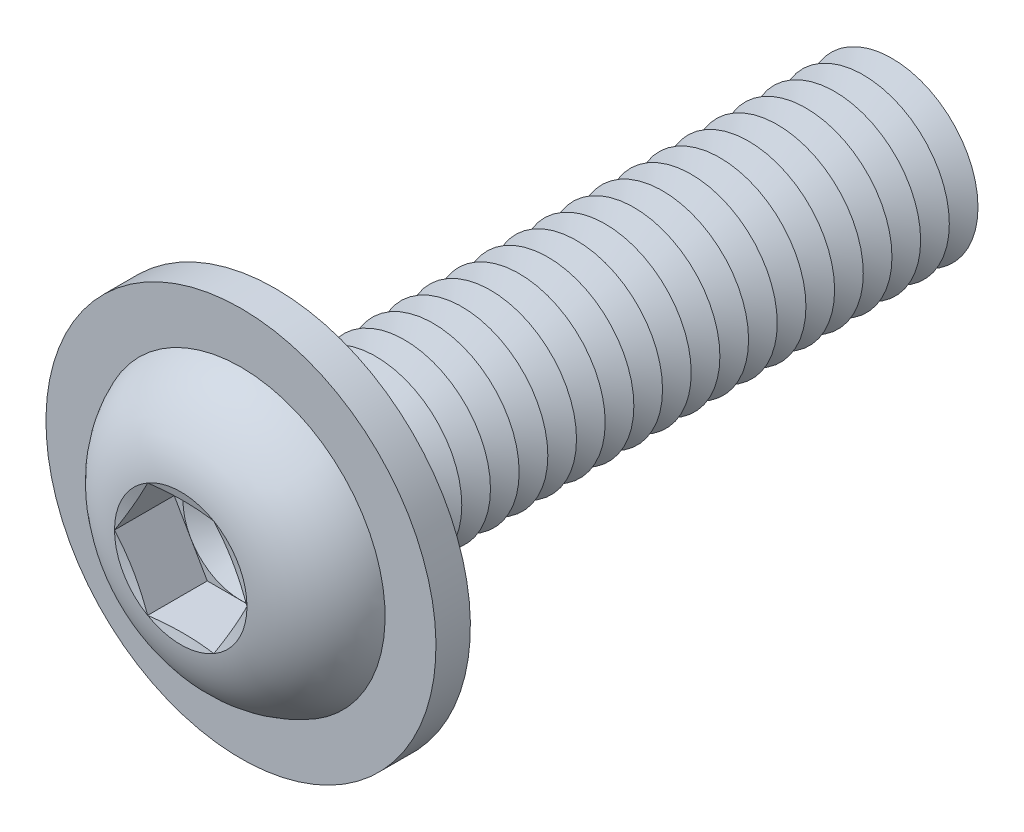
ISO-10303-21;
HEADER;
FILE_DESCRIPTION(('STEP AP214'),'2;1');
FILE_NAME('part.step','',(''),(''),'','','');
FILE_SCHEMA(('AUTOMOTIVE_DESIGN { 1 0 10303 214 1 1 1 1 }'));
ENDSEC;
DATA;
#1=APPLICATION_CONTEXT('core data for automotive mechanical design processes');
#2=APPLICATION_PROTOCOL_DEFINITION('international standard','automotive_design',2000,#1);
#3=PRODUCT_CONTEXT('',#1,'mechanical');
#4=PRODUCT('Part','Part','',(#3));
#5=PRODUCT_RELATED_PRODUCT_CATEGORY('part','',(#4));
#6=PRODUCT_DEFINITION_FORMATION('','',#4);
#7=PRODUCT_DEFINITION_CONTEXT('part definition',#1,'design');
#8=PRODUCT_DEFINITION('design','',#6,#7);
#9=PRODUCT_DEFINITION_SHAPE('','',#8);
#10=(LENGTH_UNIT() NAMED_UNIT(*) SI_UNIT(.MILLI.,.METRE.));
#11=(NAMED_UNIT(*) PLANE_ANGLE_UNIT() SI_UNIT($,.RADIAN.));
#12=(NAMED_UNIT(*) SI_UNIT($,.STERADIAN.) SOLID_ANGLE_UNIT());
#13=UNCERTAINTY_MEASURE_WITH_UNIT(LENGTH_MEASURE(1.E-05),#10,'distance_accuracy_value','');
#14=(GEOMETRIC_REPRESENTATION_CONTEXT(3) GLOBAL_UNCERTAINTY_ASSIGNED_CONTEXT((#13)) GLOBAL_UNIT_ASSIGNED_CONTEXT((#10,
#11,#12)) REPRESENTATION_CONTEXT('',''));
#15=CARTESIAN_POINT('',(0.,0.,0.));
#16=DIRECTION('',(0.,0.,1.));
#17=DIRECTION('',(1.,0.,0.));
#18=AXIS2_PLACEMENT_3D('',#15,#16,#17);
#19=CARTESIAN_POINT('',(0.,0.,-18.5));
#20=DIRECTION('',(0.,0.,1.));
#21=DIRECTION('',(1.,0.,0.));
#22=AXIS2_PLACEMENT_3D('',#19,#20,#21);
#23=CONICAL_SURFACE('',#22,3.00000000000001,1.0471975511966);
#24=CARTESIAN_POINT('',(0.,0.,-19.));
#25=DIRECTION('',(0.,0.,1.));
#26=DIRECTION('',(1.,0.,0.));
#27=AXIS2_PLACEMENT_3D('',#24,#25,#26);
#28=CIRCLE('',#27,2.13397459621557);
#29=CARTESIAN_POINT('',(2.13397459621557,0.,-19.));
#30=VERTEX_POINT('',#29);
#31=EDGE_CURVE('E386',#30,#30,#28,.T.);
#32=ORIENTED_EDGE('',*,*,#31,.T.);
#33=EDGE_LOOP('',(#32));
#34=FACE_BOUND('',#33,.T.);
#35=CARTESIAN_POINT('',(0.,0.,-18.5));
#36=DIRECTION('',(0.,0.,1.));
#37=DIRECTION('',(1.,0.,0.));
#38=AXIS2_PLACEMENT_3D('',#35,#36,#37);
#39=CIRCLE('',#38,3.00000000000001);
#40=CARTESIAN_POINT('',(3.00000000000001,0.,-18.5));
#41=VERTEX_POINT('',#40);
#42=EDGE_CURVE('E382',#41,#41,#39,.T.);
#43=ORIENTED_EDGE('',*,*,#42,.F.);
#44=EDGE_LOOP('',(#43));
#45=FACE_BOUND('',#44,.T.);
#46=ADVANCED_FACE('F39',(#34,#45),#23,.T.);
#47=CARTESIAN_POINT('',(0.,0.,-19.));
#48=DIRECTION('',(0.,0.,-1.));
#49=DIRECTION('',(-1.,0.,0.));
#50=AXIS2_PLACEMENT_3D('',#47,#48,#49);
#51=CONICAL_SURFACE('',#50,2.13397459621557,1.0471975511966);
#52=CARTESIAN_POINT('',(0.,0.,-19.5));
#53=DIRECTION('',(0.,0.,1.));
#54=DIRECTION('',(1.,0.,0.));
#55=AXIS2_PLACEMENT_3D('',#52,#53,#54);
#56=CIRCLE('',#55,3.00000000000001);
#57=CARTESIAN_POINT('',(3.00000000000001,0.,-19.5));
#58=VERTEX_POINT('',#57);
#59=EDGE_CURVE('E390',#58,#58,#56,.T.);
#60=ORIENTED_EDGE('',*,*,#59,.T.);
#61=EDGE_LOOP('',(#60));
#62=FACE_BOUND('',#61,.T.);
#63=ORIENTED_EDGE('',*,*,#31,.F.);
#64=EDGE_LOOP('',(#63));
#65=FACE_BOUND('',#64,.T.);
#66=ADVANCED_FACE('F507',(#62,#65),#51,.T.);
#67=CARTESIAN_POINT('',(0.,3.00000000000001,-22.));
#68=DIRECTION('',(0.,0.,-1.));
#69=DIRECTION('',(-1.,0.,0.));
#70=AXIS2_PLACEMENT_3D('',#67,#68,#69);
#71=PLANE('',#70);
#72=CARTESIAN_POINT('',(0.,0.,-22.));
#73=DIRECTION('',(0.,0.,1.));
#74=DIRECTION('',(1.,0.,0.));
#75=AXIS2_PLACEMENT_3D('',#72,#73,#74);
#76=CIRCLE('',#75,2.13397459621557);
#77=CARTESIAN_POINT('',(2.13397459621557,0.,-22.));
#78=VERTEX_POINT('',#77);
#79=EDGE_CURVE('E410',#78,#78,#76,.T.);
#80=ORIENTED_EDGE('',*,*,#79,.F.);
#81=EDGE_LOOP('',(#80));
#82=FACE_BOUND('',#81,.T.);
#83=ADVANCED_FACE('F513',(#82),#71,.T.);
#84=CARTESIAN_POINT('',(0.,0.,-21.5));
#85=DIRECTION('',(0.,0.,1.));
#86=DIRECTION('',(1.,0.,0.));
#87=AXIS2_PLACEMENT_3D('',#84,#85,#86);
#88=CONICAL_SURFACE('',#87,3.00000000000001,1.0471975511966);
#89=ORIENTED_EDGE('',*,*,#79,.T.);
#90=EDGE_LOOP('',(#89));
#91=FACE_BOUND('',#90,.T.);
#92=CARTESIAN_POINT('',(0.,0.,-21.5));
#93=DIRECTION('',(0.,0.,1.));
#94=DIRECTION('',(1.,0.,0.));
#95=AXIS2_PLACEMENT_3D('',#92,#93,#94);
#96=CIRCLE('',#95,3.00000000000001);
#97=CARTESIAN_POINT('',(3.00000000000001,0.,-21.5));
#98=VERTEX_POINT('',#97);
#99=EDGE_CURVE('E406',#98,#98,#96,.T.);
#100=ORIENTED_EDGE('',*,*,#99,.F.);
#101=EDGE_LOOP('',(#100));
#102=FACE_BOUND('',#101,.T.);
#103=ADVANCED_FACE('F532',(#91,#102),#88,.T.);
#104=CARTESIAN_POINT('',(0.,0.,-21.));
#105=DIRECTION('',(0.,0.,-1.));
#106=DIRECTION('',(-1.,0.,0.));
#107=AXIS2_PLACEMENT_3D('',#104,#105,#106);
#108=CONICAL_SURFACE('',#107,2.13397459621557,1.0471975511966);
#109=ORIENTED_EDGE('',*,*,#99,.T.);
#110=EDGE_LOOP('',(#109));
#111=FACE_BOUND('',#110,.T.);
#112=CARTESIAN_POINT('',(0.,0.,-21.));
#113=DIRECTION('',(0.,0.,1.));
#114=DIRECTION('',(1.,0.,0.));
#115=AXIS2_PLACEMENT_3D('',#112,#113,#114);
#116=CIRCLE('',#115,2.13397459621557);
#117=CARTESIAN_POINT('',(2.13397459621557,0.,-21.));
#118=VERTEX_POINT('',#117);
#119=EDGE_CURVE('E402',#118,#118,#116,.T.);
#120=ORIENTED_EDGE('',*,*,#119,.F.);
#121=EDGE_LOOP('',(#120));
#122=FACE_BOUND('',#121,.T.);
#123=ADVANCED_FACE('F529',(#111,#122),#108,.T.);
#124=CARTESIAN_POINT('',(0.,0.,-20.5));
#125=DIRECTION('',(0.,0.,1.));
#126=DIRECTION('',(1.,0.,0.));
#127=AXIS2_PLACEMENT_3D('',#124,#125,#126);
#128=CONICAL_SURFACE('',#127,3.00000000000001,1.0471975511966);
#129=ORIENTED_EDGE('',*,*,#119,.T.);
#130=EDGE_LOOP('',(#129));
#131=FACE_BOUND('',#130,.T.);
#132=CARTESIAN_POINT('',(0.,0.,-20.5));
#133=DIRECTION('',(0.,0.,1.));
#134=DIRECTION('',(1.,0.,0.));
#135=AXIS2_PLACEMENT_3D('',#132,#133,#134);
#136=CIRCLE('',#135,3.00000000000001);
#137=CARTESIAN_POINT('',(3.00000000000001,0.,-20.5));
#138=VERTEX_POINT('',#137);
#139=EDGE_CURVE('E398',#138,#138,#136,.T.);
#140=ORIENTED_EDGE('',*,*,#139,.F.);
#141=EDGE_LOOP('',(#140));
#142=FACE_BOUND('',#141,.T.);
#143=ADVANCED_FACE('F523',(#131,#142),#128,.T.);
#144=CARTESIAN_POINT('',(0.,0.,-20.));
#145=DIRECTION('',(0.,0.,-1.));
#146=DIRECTION('',(-1.,0.,0.));
#147=AXIS2_PLACEMENT_3D('',#144,#145,#146);
#148=CONICAL_SURFACE('',#147,2.13397459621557,1.0471975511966);
#149=ORIENTED_EDGE('',*,*,#139,.T.);
#150=EDGE_LOOP('',(#149));
#151=FACE_BOUND('',#150,.T.);
#152=CARTESIAN_POINT('',(0.,0.,-20.));
#153=DIRECTION('',(0.,0.,1.));
#154=DIRECTION('',(1.,0.,0.));
#155=AXIS2_PLACEMENT_3D('',#152,#153,#154);
#156=CIRCLE('',#155,2.13397459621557);
#157=CARTESIAN_POINT('',(2.13397459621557,0.,-20.));
#158=VERTEX_POINT('',#157);
#159=EDGE_CURVE('E394',#158,#158,#156,.T.);
#160=ORIENTED_EDGE('',*,*,#159,.F.);
#161=EDGE_LOOP('',(#160));
#162=FACE_BOUND('',#161,.T.);
#163=ADVANCED_FACE('F519',(#151,#162),#148,.T.);
#164=CARTESIAN_POINT('',(0.,0.,-19.5));
#165=DIRECTION('',(0.,0.,1.));
#166=DIRECTION('',(1.,0.,0.));
#167=AXIS2_PLACEMENT_3D('',#164,#165,#166);
#168=CONICAL_SURFACE('',#167,3.00000000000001,1.0471975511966);
#169=ORIENTED_EDGE('',*,*,#159,.T.);
#170=EDGE_LOOP('',(#169));
#171=FACE_BOUND('',#170,.T.);
#172=ORIENTED_EDGE('',*,*,#59,.F.);
#173=EDGE_LOOP('',(#172));
#174=FACE_BOUND('',#173,.T.);
#175=ADVANCED_FACE('F522',(#171,#174),#168,.T.);
#176=CARTESIAN_POINT('',(0.,0.,-17.5));
#177=DIRECTION('',(0.,0.,1.));
#178=DIRECTION('',(1.,0.,0.));
#179=AXIS2_PLACEMENT_3D('',#176,#177,#178);
#180=CONICAL_SURFACE('',#179,3.00000000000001,1.0471975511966);
#181=CARTESIAN_POINT('',(0.,0.,-18.));
#182=DIRECTION('',(0.,0.,1.));
#183=DIRECTION('',(1.,0.,0.));
#184=AXIS2_PLACEMENT_3D('',#181,#182,#183);
#185=CIRCLE('',#184,2.13397459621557);
#186=CARTESIAN_POINT('',(2.13397459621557,0.,-18.));
#187=VERTEX_POINT('',#186);
#188=EDGE_CURVE('E378',#187,#187,#185,.T.);
#189=ORIENTED_EDGE('',*,*,#188,.T.);
#190=EDGE_LOOP('',(#189));
#191=FACE_BOUND('',#190,.T.);
#192=CARTESIAN_POINT('',(0.,0.,-17.5));
#193=DIRECTION('',(0.,0.,1.));
#194=DIRECTION('',(1.,0.,0.));
#195=AXIS2_PLACEMENT_3D('',#192,#193,#194);
#196=CIRCLE('',#195,3.00000000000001);
#197=CARTESIAN_POINT('',(3.00000000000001,0.,-17.5));
#198=VERTEX_POINT('',#197);
#199=EDGE_CURVE('E374',#198,#198,#196,.T.);
#200=ORIENTED_EDGE('',*,*,#199,.F.);
#201=EDGE_LOOP('',(#200));
#202=FACE_BOUND('',#201,.T.);
#203=ADVANCED_FACE('F527',(#191,#202),#180,.T.);
#204=CARTESIAN_POINT('',(0.,0.,-18.));
#205=DIRECTION('',(0.,0.,-1.));
#206=DIRECTION('',(-1.,0.,0.));
#207=AXIS2_PLACEMENT_3D('',#204,#205,#206);
#208=CONICAL_SURFACE('',#207,2.13397459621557,1.0471975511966);
#209=ORIENTED_EDGE('',*,*,#42,.T.);
#210=EDGE_LOOP('',(#209));
#211=FACE_BOUND('',#210,.T.);
#212=ORIENTED_EDGE('',*,*,#188,.F.);
#213=EDGE_LOOP('',(#212));
#214=FACE_BOUND('',#213,.T.);
#215=ADVANCED_FACE('F578',(#211,#214),#208,.T.);
#216=CARTESIAN_POINT('',(0.,0.,-16.5));
#217=DIRECTION('',(0.,0.,1.));
#218=DIRECTION('',(1.,0.,0.));
#219=AXIS2_PLACEMENT_3D('',#216,#217,#218);
#220=CONICAL_SURFACE('',#219,3.00000000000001,1.0471975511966);
#221=CARTESIAN_POINT('',(0.,0.,-17.));
#222=DIRECTION('',(0.,0.,1.));
#223=DIRECTION('',(1.,0.,0.));
#224=AXIS2_PLACEMENT_3D('',#221,#222,#223);
#225=CIRCLE('',#224,2.13397459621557);
#226=CARTESIAN_POINT('',(2.13397459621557,0.,-17.));
#227=VERTEX_POINT('',#226);
#228=EDGE_CURVE('E370',#227,#227,#225,.T.);
#229=ORIENTED_EDGE('',*,*,#228,.T.);
#230=EDGE_LOOP('',(#229));
#231=FACE_BOUND('',#230,.T.);
#232=CARTESIAN_POINT('',(0.,0.,-16.5));
#233=DIRECTION('',(0.,0.,1.));
#234=DIRECTION('',(1.,0.,0.));
#235=AXIS2_PLACEMENT_3D('',#232,#233,#234);
#236=CIRCLE('',#235,3.00000000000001);
#237=CARTESIAN_POINT('',(3.00000000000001,0.,-16.5));
#238=VERTEX_POINT('',#237);
#239=EDGE_CURVE('E366',#238,#238,#236,.T.);
#240=ORIENTED_EDGE('',*,*,#239,.F.);
#241=EDGE_LOOP('',(#240));
#242=FACE_BOUND('',#241,.T.);
#243=ADVANCED_FACE('F584',(#231,#242),#220,.T.);
#244=CARTESIAN_POINT('',(0.,0.,-17.));
#245=DIRECTION('',(0.,0.,-1.));
#246=DIRECTION('',(-1.,0.,0.));
#247=AXIS2_PLACEMENT_3D('',#244,#245,#246);
#248=CONICAL_SURFACE('',#247,2.13397459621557,1.0471975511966);
#249=ORIENTED_EDGE('',*,*,#199,.T.);
#250=EDGE_LOOP('',(#249));
#251=FACE_BOUND('',#250,.T.);
#252=ORIENTED_EDGE('',*,*,#228,.F.);
#253=EDGE_LOOP('',(#252));
#254=FACE_BOUND('',#253,.T.);
#255=ADVANCED_FACE('F591',(#251,#254),#248,.T.);
#256=CARTESIAN_POINT('',(0.,0.,-15.5));
#257=DIRECTION('',(0.,0.,1.));
#258=DIRECTION('',(1.,0.,0.));
#259=AXIS2_PLACEMENT_3D('',#256,#257,#258);
#260=CONICAL_SURFACE('',#259,3.00000000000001,1.0471975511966);
#261=CARTESIAN_POINT('',(0.,0.,-16.));
#262=DIRECTION('',(0.,0.,1.));
#263=DIRECTION('',(1.,0.,0.));
#264=AXIS2_PLACEMENT_3D('',#261,#262,#263);
#265=CIRCLE('',#264,2.13397459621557);
#266=CARTESIAN_POINT('',(2.13397459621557,0.,-16.));
#267=VERTEX_POINT('',#266);
#268=EDGE_CURVE('E362',#267,#267,#265,.T.);
#269=ORIENTED_EDGE('',*,*,#268,.T.);
#270=EDGE_LOOP('',(#269));
#271=FACE_BOUND('',#270,.T.);
#272=CARTESIAN_POINT('',(0.,0.,-15.5));
#273=DIRECTION('',(0.,0.,1.));
#274=DIRECTION('',(1.,0.,0.));
#275=AXIS2_PLACEMENT_3D('',#272,#273,#274);
#276=CIRCLE('',#275,3.00000000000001);
#277=CARTESIAN_POINT('',(3.00000000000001,0.,-15.5));
#278=VERTEX_POINT('',#277);
#279=EDGE_CURVE('E358',#278,#278,#276,.T.);
#280=ORIENTED_EDGE('',*,*,#279,.F.);
#281=EDGE_LOOP('',(#280));
#282=FACE_BOUND('',#281,.T.);
#283=ADVANCED_FACE('F598',(#271,#282),#260,.T.);
#284=CARTESIAN_POINT('',(0.,0.,-16.));
#285=DIRECTION('',(0.,0.,-1.));
#286=DIRECTION('',(-1.,0.,0.));
#287=AXIS2_PLACEMENT_3D('',#284,#285,#286);
#288=CONICAL_SURFACE('',#287,2.13397459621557,1.0471975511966);
#289=ORIENTED_EDGE('',*,*,#239,.T.);
#290=EDGE_LOOP('',(#289));
#291=FACE_BOUND('',#290,.T.);
#292=ORIENTED_EDGE('',*,*,#268,.F.);
#293=EDGE_LOOP('',(#292));
#294=FACE_BOUND('',#293,.T.);
#295=ADVANCED_FACE('F605',(#291,#294),#288,.T.);
#296=CARTESIAN_POINT('',(0.,0.,-14.5));
#297=DIRECTION('',(0.,0.,1.));
#298=DIRECTION('',(1.,0.,0.));
#299=AXIS2_PLACEMENT_3D('',#296,#297,#298);
#300=CONICAL_SURFACE('',#299,3.00000000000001,1.0471975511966);
#301=CARTESIAN_POINT('',(0.,0.,-15.));
#302=DIRECTION('',(0.,0.,1.));
#303=DIRECTION('',(1.,0.,0.));
#304=AXIS2_PLACEMENT_3D('',#301,#302,#303);
#305=CIRCLE('',#304,2.13397459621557);
#306=CARTESIAN_POINT('',(2.13397459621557,0.,-15.));
#307=VERTEX_POINT('',#306);
#308=EDGE_CURVE('E354',#307,#307,#305,.T.);
#309=ORIENTED_EDGE('',*,*,#308,.T.);
#310=EDGE_LOOP('',(#309));
#311=FACE_BOUND('',#310,.T.);
#312=CARTESIAN_POINT('',(0.,0.,-14.5));
#313=DIRECTION('',(0.,0.,1.));
#314=DIRECTION('',(1.,0.,0.));
#315=AXIS2_PLACEMENT_3D('',#312,#313,#314);
#316=CIRCLE('',#315,3.00000000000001);
#317=CARTESIAN_POINT('',(3.00000000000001,0.,-14.5));
#318=VERTEX_POINT('',#317);
#319=EDGE_CURVE('E350',#318,#318,#316,.T.);
#320=ORIENTED_EDGE('',*,*,#319,.F.);
#321=EDGE_LOOP('',(#320));
#322=FACE_BOUND('',#321,.T.);
#323=ADVANCED_FACE('F612',(#311,#322),#300,.T.);
#324=CARTESIAN_POINT('',(0.,0.,-15.));
#325=DIRECTION('',(0.,0.,-1.));
#326=DIRECTION('',(-1.,0.,0.));
#327=AXIS2_PLACEMENT_3D('',#324,#325,#326);
#328=CONICAL_SURFACE('',#327,2.13397459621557,1.0471975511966);
#329=ORIENTED_EDGE('',*,*,#279,.T.);
#330=EDGE_LOOP('',(#329));
#331=FACE_BOUND('',#330,.T.);
#332=ORIENTED_EDGE('',*,*,#308,.F.);
#333=EDGE_LOOP('',(#332));
#334=FACE_BOUND('',#333,.T.);
#335=ADVANCED_FACE('F619',(#331,#334),#328,.T.);
#336=CARTESIAN_POINT('',(0.,0.,-13.5));
#337=DIRECTION('',(0.,0.,1.));
#338=DIRECTION('',(1.,0.,0.));
#339=AXIS2_PLACEMENT_3D('',#336,#337,#338);
#340=CONICAL_SURFACE('',#339,3.00000000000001,1.0471975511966);
#341=CARTESIAN_POINT('',(0.,0.,-14.));
#342=DIRECTION('',(0.,0.,1.));
#343=DIRECTION('',(1.,0.,0.));
#344=AXIS2_PLACEMENT_3D('',#341,#342,#343);
#345=CIRCLE('',#344,2.13397459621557);
#346=CARTESIAN_POINT('',(2.13397459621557,0.,-14.));
#347=VERTEX_POINT('',#346);
#348=EDGE_CURVE('E346',#347,#347,#345,.T.);
#349=ORIENTED_EDGE('',*,*,#348,.T.);
#350=EDGE_LOOP('',(#349));
#351=FACE_BOUND('',#350,.T.);
#352=CARTESIAN_POINT('',(0.,0.,-13.5));
#353=DIRECTION('',(0.,0.,1.));
#354=DIRECTION('',(1.,0.,0.));
#355=AXIS2_PLACEMENT_3D('',#352,#353,#354);
#356=CIRCLE('',#355,3.00000000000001);
#357=CARTESIAN_POINT('',(3.00000000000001,0.,-13.5));
#358=VERTEX_POINT('',#357);
#359=EDGE_CURVE('E342',#358,#358,#356,.T.);
#360=ORIENTED_EDGE('',*,*,#359,.F.);
#361=EDGE_LOOP('',(#360));
#362=FACE_BOUND('',#361,.T.);
#363=ADVANCED_FACE('F626',(#351,#362),#340,.T.);
#364=CARTESIAN_POINT('',(0.,0.,-14.));
#365=DIRECTION('',(0.,0.,-1.));
#366=DIRECTION('',(-1.,0.,0.));
#367=AXIS2_PLACEMENT_3D('',#364,#365,#366);
#368=CONICAL_SURFACE('',#367,2.13397459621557,1.0471975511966);
#369=ORIENTED_EDGE('',*,*,#319,.T.);
#370=EDGE_LOOP('',(#369));
#371=FACE_BOUND('',#370,.T.);
#372=ORIENTED_EDGE('',*,*,#348,.F.);
#373=EDGE_LOOP('',(#372));
#374=FACE_BOUND('',#373,.T.);
#375=ADVANCED_FACE('F633',(#371,#374),#368,.T.);
#376=CARTESIAN_POINT('',(0.,0.,-12.5));
#377=DIRECTION('',(0.,0.,1.));
#378=DIRECTION('',(1.,0.,0.));
#379=AXIS2_PLACEMENT_3D('',#376,#377,#378);
#380=CONICAL_SURFACE('',#379,3.00000000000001,1.0471975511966);
#381=CARTESIAN_POINT('',(0.,0.,-13.));
#382=DIRECTION('',(0.,0.,1.));
#383=DIRECTION('',(1.,0.,0.));
#384=AXIS2_PLACEMENT_3D('',#381,#382,#383);
#385=CIRCLE('',#384,2.13397459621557);
#386=CARTESIAN_POINT('',(2.13397459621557,0.,-13.));
#387=VERTEX_POINT('',#386);
#388=EDGE_CURVE('E339',#387,#387,#385,.T.);
#389=ORIENTED_EDGE('',*,*,#388,.T.);
#390=EDGE_LOOP('',(#389));
#391=FACE_BOUND('',#390,.T.);
#392=CARTESIAN_POINT('',(0.,0.,-12.5));
#393=DIRECTION('',(0.,0.,1.));
#394=DIRECTION('',(1.,0.,0.));
#395=AXIS2_PLACEMENT_3D('',#392,#393,#394);
#396=CIRCLE('',#395,3.00000000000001);
#397=CARTESIAN_POINT('',(3.00000000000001,0.,-12.5));
#398=VERTEX_POINT('',#397);
#399=EDGE_CURVE('E335',#398,#398,#396,.T.);
#400=ORIENTED_EDGE('',*,*,#399,.F.);
#401=EDGE_LOOP('',(#400));
#402=FACE_BOUND('',#401,.T.);
#403=ADVANCED_FACE('F640',(#391,#402),#380,.T.);
#404=CARTESIAN_POINT('',(0.,0.,-13.));
#405=DIRECTION('',(0.,0.,-1.));
#406=DIRECTION('',(-1.,0.,0.));
#407=AXIS2_PLACEMENT_3D('',#404,#405,#406);
#408=CONICAL_SURFACE('',#407,2.13397459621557,1.0471975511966);
#409=ORIENTED_EDGE('',*,*,#359,.T.);
#410=EDGE_LOOP('',(#409));
#411=FACE_BOUND('',#410,.T.);
#412=ORIENTED_EDGE('',*,*,#388,.F.);
#413=EDGE_LOOP('',(#412));
#414=FACE_BOUND('',#413,.T.);
#415=ADVANCED_FACE('F647',(#411,#414),#408,.T.);
#416=CARTESIAN_POINT('',(0.,0.,-11.5));
#417=DIRECTION('',(0.,0.,1.));
#418=DIRECTION('',(1.,0.,0.));
#419=AXIS2_PLACEMENT_3D('',#416,#417,#418);
#420=CONICAL_SURFACE('',#419,3.00000000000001,1.0471975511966);
#421=CARTESIAN_POINT('',(0.,0.,-12.));
#422=DIRECTION('',(0.,0.,1.));
#423=DIRECTION('',(1.,0.,0.));
#424=AXIS2_PLACEMENT_3D('',#421,#422,#423);
#425=CIRCLE('',#424,2.13397459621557);
#426=CARTESIAN_POINT('',(2.13397459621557,0.,-12.));
#427=VERTEX_POINT('',#426);
#428=EDGE_CURVE('E331',#427,#427,#425,.T.);
#429=ORIENTED_EDGE('',*,*,#428,.T.);
#430=EDGE_LOOP('',(#429));
#431=FACE_BOUND('',#430,.T.);
#432=CARTESIAN_POINT('',(0.,0.,-11.5));
#433=DIRECTION('',(0.,0.,1.));
#434=DIRECTION('',(1.,0.,0.));
#435=AXIS2_PLACEMENT_3D('',#432,#433,#434);
#436=CIRCLE('',#435,3.00000000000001);
#437=CARTESIAN_POINT('',(3.00000000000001,0.,-11.5));
#438=VERTEX_POINT('',#437);
#439=EDGE_CURVE('E327',#438,#438,#436,.T.);
#440=ORIENTED_EDGE('',*,*,#439,.F.);
#441=EDGE_LOOP('',(#440));
#442=FACE_BOUND('',#441,.T.);
#443=ADVANCED_FACE('F654',(#431,#442),#420,.T.);
#444=CARTESIAN_POINT('',(0.,0.,-12.));
#445=DIRECTION('',(0.,0.,-1.));
#446=DIRECTION('',(-1.,0.,0.));
#447=AXIS2_PLACEMENT_3D('',#444,#445,#446);
#448=CONICAL_SURFACE('',#447,2.13397459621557,1.0471975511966);
#449=ORIENTED_EDGE('',*,*,#399,.T.);
#450=EDGE_LOOP('',(#449));
#451=FACE_BOUND('',#450,.T.);
#452=ORIENTED_EDGE('',*,*,#428,.F.);
#453=EDGE_LOOP('',(#452));
#454=FACE_BOUND('',#453,.T.);
#455=ADVANCED_FACE('F661',(#451,#454),#448,.T.);
#456=CARTESIAN_POINT('',(0.,0.,-10.5));
#457=DIRECTION('',(0.,0.,1.));
#458=DIRECTION('',(1.,0.,0.));
#459=AXIS2_PLACEMENT_3D('',#456,#457,#458);
#460=CONICAL_SURFACE('',#459,3.00000000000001,1.0471975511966);
#461=CARTESIAN_POINT('',(0.,0.,-11.));
#462=DIRECTION('',(0.,0.,1.));
#463=DIRECTION('',(1.,0.,0.));
#464=AXIS2_PLACEMENT_3D('',#461,#462,#463);
#465=CIRCLE('',#464,2.13397459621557);
#466=CARTESIAN_POINT('',(2.13397459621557,0.,-11.));
#467=VERTEX_POINT('',#466);
#468=EDGE_CURVE('E323',#467,#467,#465,.T.);
#469=ORIENTED_EDGE('',*,*,#468,.T.);
#470=EDGE_LOOP('',(#469));
#471=FACE_BOUND('',#470,.T.);
#472=CARTESIAN_POINT('',(0.,0.,-10.5));
#473=DIRECTION('',(0.,0.,1.));
#474=DIRECTION('',(1.,0.,0.));
#475=AXIS2_PLACEMENT_3D('',#472,#473,#474);
#476=CIRCLE('',#475,3.00000000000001);
#477=CARTESIAN_POINT('',(3.00000000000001,0.,-10.5));
#478=VERTEX_POINT('',#477);
#479=EDGE_CURVE('E319',#478,#478,#476,.T.);
#480=ORIENTED_EDGE('',*,*,#479,.F.);
#481=EDGE_LOOP('',(#480));
#482=FACE_BOUND('',#481,.T.);
#483=ADVANCED_FACE('F668',(#471,#482),#460,.T.);
#484=CARTESIAN_POINT('',(0.,0.,-11.));
#485=DIRECTION('',(0.,0.,-1.));
#486=DIRECTION('',(-1.,0.,0.));
#487=AXIS2_PLACEMENT_3D('',#484,#485,#486);
#488=CONICAL_SURFACE('',#487,2.13397459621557,1.0471975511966);
#489=ORIENTED_EDGE('',*,*,#439,.T.);
#490=EDGE_LOOP('',(#489));
#491=FACE_BOUND('',#490,.T.);
#492=ORIENTED_EDGE('',*,*,#468,.F.);
#493=EDGE_LOOP('',(#492));
#494=FACE_BOUND('',#493,.T.);
#495=ADVANCED_FACE('F675',(#491,#494),#488,.T.);
#496=CARTESIAN_POINT('',(0.,0.,-9.5));
#497=DIRECTION('',(0.,0.,1.));
#498=DIRECTION('',(1.,0.,0.));
#499=AXIS2_PLACEMENT_3D('',#496,#497,#498);
#500=CONICAL_SURFACE('',#499,3.00000000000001,1.0471975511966);
#501=CARTESIAN_POINT('',(0.,0.,-10.));
#502=DIRECTION('',(0.,0.,1.));
#503=DIRECTION('',(1.,0.,0.));
#504=AXIS2_PLACEMENT_3D('',#501,#502,#503);
#505=CIRCLE('',#504,2.13397459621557);
#506=CARTESIAN_POINT('',(2.13397459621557,0.,-10.));
#507=VERTEX_POINT('',#506);
#508=EDGE_CURVE('E315',#507,#507,#505,.T.);
#509=ORIENTED_EDGE('',*,*,#508,.T.);
#510=EDGE_LOOP('',(#509));
#511=FACE_BOUND('',#510,.T.);
#512=CARTESIAN_POINT('',(0.,0.,-9.5));
#513=DIRECTION('',(0.,0.,1.));
#514=DIRECTION('',(1.,0.,0.));
#515=AXIS2_PLACEMENT_3D('',#512,#513,#514);
#516=CIRCLE('',#515,3.00000000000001);
#517=CARTESIAN_POINT('',(3.00000000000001,0.,-9.5));
#518=VERTEX_POINT('',#517);
#519=EDGE_CURVE('E311',#518,#518,#516,.T.);
#520=ORIENTED_EDGE('',*,*,#519,.F.);
#521=EDGE_LOOP('',(#520));
#522=FACE_BOUND('',#521,.T.);
#523=ADVANCED_FACE('F682',(#511,#522),#500,.T.);
#524=CARTESIAN_POINT('',(0.,0.,-10.));
#525=DIRECTION('',(0.,0.,-1.));
#526=DIRECTION('',(-1.,0.,0.));
#527=AXIS2_PLACEMENT_3D('',#524,#525,#526);
#528=CONICAL_SURFACE('',#527,2.13397459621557,1.0471975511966);
#529=ORIENTED_EDGE('',*,*,#479,.T.);
#530=EDGE_LOOP('',(#529));
#531=FACE_BOUND('',#530,.T.);
#532=ORIENTED_EDGE('',*,*,#508,.F.);
#533=EDGE_LOOP('',(#532));
#534=FACE_BOUND('',#533,.T.);
#535=ADVANCED_FACE('F689',(#531,#534),#528,.T.);
#536=CARTESIAN_POINT('',(0.,0.,-8.5));
#537=DIRECTION('',(0.,0.,1.));
#538=DIRECTION('',(1.,0.,0.));
#539=AXIS2_PLACEMENT_3D('',#536,#537,#538);
#540=CONICAL_SURFACE('',#539,3.00000000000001,1.0471975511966);
#541=CARTESIAN_POINT('',(0.,0.,-9.));
#542=DIRECTION('',(0.,0.,1.));
#543=DIRECTION('',(1.,0.,0.));
#544=AXIS2_PLACEMENT_3D('',#541,#542,#543);
#545=CIRCLE('',#544,2.13397459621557);
#546=CARTESIAN_POINT('',(2.13397459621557,0.,-9.));
#547=VERTEX_POINT('',#546);
#548=EDGE_CURVE('E307',#547,#547,#545,.T.);
#549=ORIENTED_EDGE('',*,*,#548,.T.);
#550=EDGE_LOOP('',(#549));
#551=FACE_BOUND('',#550,.T.);
#552=CARTESIAN_POINT('',(0.,0.,-8.5));
#553=DIRECTION('',(0.,0.,1.));
#554=DIRECTION('',(1.,0.,0.));
#555=AXIS2_PLACEMENT_3D('',#552,#553,#554);
#556=CIRCLE('',#555,3.00000000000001);
#557=CARTESIAN_POINT('',(3.00000000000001,0.,-8.5));
#558=VERTEX_POINT('',#557);
#559=EDGE_CURVE('E303',#558,#558,#556,.T.);
#560=ORIENTED_EDGE('',*,*,#559,.F.);
#561=EDGE_LOOP('',(#560));
#562=FACE_BOUND('',#561,.T.);
#563=ADVANCED_FACE('F696',(#551,#562),#540,.T.);
#564=CARTESIAN_POINT('',(0.,0.,-9.));
#565=DIRECTION('',(0.,0.,-1.));
#566=DIRECTION('',(-1.,0.,0.));
#567=AXIS2_PLACEMENT_3D('',#564,#565,#566);
#568=CONICAL_SURFACE('',#567,2.13397459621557,1.0471975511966);
#569=ORIENTED_EDGE('',*,*,#519,.T.);
#570=EDGE_LOOP('',(#569));
#571=FACE_BOUND('',#570,.T.);
#572=ORIENTED_EDGE('',*,*,#548,.F.);
#573=EDGE_LOOP('',(#572));
#574=FACE_BOUND('',#573,.T.);
#575=ADVANCED_FACE('F703',(#571,#574),#568,.T.);
#576=CARTESIAN_POINT('',(0.,0.,-7.5));
#577=DIRECTION('',(0.,0.,1.));
#578=DIRECTION('',(1.,0.,0.));
#579=AXIS2_PLACEMENT_3D('',#576,#577,#578);
#580=CONICAL_SURFACE('',#579,3.00000000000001,1.0471975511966);
#581=CARTESIAN_POINT('',(0.,0.,-8.));
#582=DIRECTION('',(0.,0.,1.));
#583=DIRECTION('',(1.,0.,0.));
#584=AXIS2_PLACEMENT_3D('',#581,#582,#583);
#585=CIRCLE('',#584,2.13397459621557);
#586=CARTESIAN_POINT('',(2.13397459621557,0.,-8.));
#587=VERTEX_POINT('',#586);
#588=EDGE_CURVE('E299',#587,#587,#585,.T.);
#589=ORIENTED_EDGE('',*,*,#588,.T.);
#590=EDGE_LOOP('',(#589));
#591=FACE_BOUND('',#590,.T.);
#592=CARTESIAN_POINT('',(0.,0.,-7.5));
#593=DIRECTION('',(0.,0.,1.));
#594=DIRECTION('',(1.,0.,0.));
#595=AXIS2_PLACEMENT_3D('',#592,#593,#594);
#596=CIRCLE('',#595,3.00000000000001);
#597=CARTESIAN_POINT('',(3.00000000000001,0.,-7.5));
#598=VERTEX_POINT('',#597);
#599=EDGE_CURVE('E295',#598,#598,#596,.T.);
#600=ORIENTED_EDGE('',*,*,#599,.F.);
#601=EDGE_LOOP('',(#600));
#602=FACE_BOUND('',#601,.T.);
#603=ADVANCED_FACE('F710',(#591,#602),#580,.T.);
#604=CARTESIAN_POINT('',(0.,0.,-8.));
#605=DIRECTION('',(0.,0.,-1.));
#606=DIRECTION('',(-1.,0.,0.));
#607=AXIS2_PLACEMENT_3D('',#604,#605,#606);
#608=CONICAL_SURFACE('',#607,2.13397459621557,1.0471975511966);
#609=ORIENTED_EDGE('',*,*,#559,.T.);
#610=EDGE_LOOP('',(#609));
#611=FACE_BOUND('',#610,.T.);
#612=ORIENTED_EDGE('',*,*,#588,.F.);
#613=EDGE_LOOP('',(#612));
#614=FACE_BOUND('',#613,.T.);
#615=ADVANCED_FACE('F717',(#611,#614),#608,.T.);
#616=CARTESIAN_POINT('',(0.,0.,-6.5));
#617=DIRECTION('',(0.,0.,1.));
#618=DIRECTION('',(1.,0.,0.));
#619=AXIS2_PLACEMENT_3D('',#616,#617,#618);
#620=CONICAL_SURFACE('',#619,3.00000000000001,1.0471975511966);
#621=CARTESIAN_POINT('',(0.,0.,-7.));
#622=DIRECTION('',(0.,0.,1.));
#623=DIRECTION('',(1.,0.,0.));
#624=AXIS2_PLACEMENT_3D('',#621,#622,#623);
#625=CIRCLE('',#624,2.13397459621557);
#626=CARTESIAN_POINT('',(2.13397459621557,0.,-7.));
#627=VERTEX_POINT('',#626);
#628=EDGE_CURVE('E291',#627,#627,#625,.T.);
#629=ORIENTED_EDGE('',*,*,#628,.T.);
#630=EDGE_LOOP('',(#629));
#631=FACE_BOUND('',#630,.T.);
#632=CARTESIAN_POINT('',(0.,0.,-6.5));
#633=DIRECTION('',(0.,0.,1.));
#634=DIRECTION('',(1.,0.,0.));
#635=AXIS2_PLACEMENT_3D('',#632,#633,#634);
#636=CIRCLE('',#635,3.00000000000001);
#637=CARTESIAN_POINT('',(3.00000000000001,0.,-6.5));
#638=VERTEX_POINT('',#637);
#639=EDGE_CURVE('E287',#638,#638,#636,.T.);
#640=ORIENTED_EDGE('',*,*,#639,.F.);
#641=EDGE_LOOP('',(#640));
#642=FACE_BOUND('',#641,.T.);
#643=ADVANCED_FACE('F724',(#631,#642),#620,.T.);
#644=CARTESIAN_POINT('',(0.,0.,-7.));
#645=DIRECTION('',(0.,0.,-1.));
#646=DIRECTION('',(-1.,0.,0.));
#647=AXIS2_PLACEMENT_3D('',#644,#645,#646);
#648=CONICAL_SURFACE('',#647,2.13397459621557,1.0471975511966);
#649=ORIENTED_EDGE('',*,*,#599,.T.);
#650=EDGE_LOOP('',(#649));
#651=FACE_BOUND('',#650,.T.);
#652=ORIENTED_EDGE('',*,*,#628,.F.);
#653=EDGE_LOOP('',(#652));
#654=FACE_BOUND('',#653,.T.);
#655=ADVANCED_FACE('F731',(#651,#654),#648,.T.);
#656=CARTESIAN_POINT('',(0.,0.,-5.5));
#657=DIRECTION('',(0.,0.,1.));
#658=DIRECTION('',(1.,0.,0.));
#659=AXIS2_PLACEMENT_3D('',#656,#657,#658);
#660=CONICAL_SURFACE('',#659,3.00000000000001,1.0471975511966);
#661=CARTESIAN_POINT('',(0.,0.,-6.));
#662=DIRECTION('',(0.,0.,1.));
#663=DIRECTION('',(1.,0.,0.));
#664=AXIS2_PLACEMENT_3D('',#661,#662,#663);
#665=CIRCLE('',#664,2.13397459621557);
#666=CARTESIAN_POINT('',(2.13397459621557,0.,-6.));
#667=VERTEX_POINT('',#666);
#668=EDGE_CURVE('E283',#667,#667,#665,.T.);
#669=ORIENTED_EDGE('',*,*,#668,.T.);
#670=EDGE_LOOP('',(#669));
#671=FACE_BOUND('',#670,.T.);
#672=CARTESIAN_POINT('',(0.,0.,-5.5));
#673=DIRECTION('',(0.,0.,1.));
#674=DIRECTION('',(1.,0.,0.));
#675=AXIS2_PLACEMENT_3D('',#672,#673,#674);
#676=CIRCLE('',#675,3.00000000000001);
#677=CARTESIAN_POINT('',(3.00000000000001,0.,-5.5));
#678=VERTEX_POINT('',#677);
#679=EDGE_CURVE('E279',#678,#678,#676,.T.);
#680=ORIENTED_EDGE('',*,*,#679,.F.);
#681=EDGE_LOOP('',(#680));
#682=FACE_BOUND('',#681,.T.);
#683=ADVANCED_FACE('F738',(#671,#682),#660,.T.);
#684=CARTESIAN_POINT('',(0.,0.,-6.));
#685=DIRECTION('',(0.,0.,-1.));
#686=DIRECTION('',(-1.,0.,0.));
#687=AXIS2_PLACEMENT_3D('',#684,#685,#686);
#688=CONICAL_SURFACE('',#687,2.13397459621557,1.0471975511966);
#689=ORIENTED_EDGE('',*,*,#639,.T.);
#690=EDGE_LOOP('',(#689));
#691=FACE_BOUND('',#690,.T.);
#692=ORIENTED_EDGE('',*,*,#668,.F.);
#693=EDGE_LOOP('',(#692));
#694=FACE_BOUND('',#693,.T.);
#695=ADVANCED_FACE('F745',(#691,#694),#688,.T.);
#696=CARTESIAN_POINT('',(0.,0.,-4.5));
#697=DIRECTION('',(0.,0.,1.));
#698=DIRECTION('',(1.,0.,0.));
#699=AXIS2_PLACEMENT_3D('',#696,#697,#698);
#700=CONICAL_SURFACE('',#699,3.00000000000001,1.0471975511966);
#701=CARTESIAN_POINT('',(0.,0.,-5.));
#702=DIRECTION('',(0.,0.,1.));
#703=DIRECTION('',(1.,0.,0.));
#704=AXIS2_PLACEMENT_3D('',#701,#702,#703);
#705=CIRCLE('',#704,2.13397459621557);
#706=CARTESIAN_POINT('',(2.13397459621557,0.,-5.));
#707=VERTEX_POINT('',#706);
#708=EDGE_CURVE('E275',#707,#707,#705,.T.);
#709=ORIENTED_EDGE('',*,*,#708,.T.);
#710=EDGE_LOOP('',(#709));
#711=FACE_BOUND('',#710,.T.);
#712=CARTESIAN_POINT('',(0.,0.,-4.5));
#713=DIRECTION('',(0.,0.,1.));
#714=DIRECTION('',(1.,0.,0.));
#715=AXIS2_PLACEMENT_3D('',#712,#713,#714);
#716=CIRCLE('',#715,3.00000000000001);
#717=CARTESIAN_POINT('',(3.00000000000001,0.,-4.5));
#718=VERTEX_POINT('',#717);
#719=EDGE_CURVE('E271',#718,#718,#716,.T.);
#720=ORIENTED_EDGE('',*,*,#719,.F.);
#721=EDGE_LOOP('',(#720));
#722=FACE_BOUND('',#721,.T.);
#723=ADVANCED_FACE('F752',(#711,#722),#700,.T.);
#724=CARTESIAN_POINT('',(0.,0.,-5.));
#725=DIRECTION('',(0.,0.,-1.));
#726=DIRECTION('',(-1.,0.,0.));
#727=AXIS2_PLACEMENT_3D('',#724,#725,#726);
#728=CONICAL_SURFACE('',#727,2.13397459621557,1.0471975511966);
#729=ORIENTED_EDGE('',*,*,#679,.T.);
#730=EDGE_LOOP('',(#729));
#731=FACE_BOUND('',#730,.T.);
#732=ORIENTED_EDGE('',*,*,#708,.F.);
#733=EDGE_LOOP('',(#732));
#734=FACE_BOUND('',#733,.T.);
#735=ADVANCED_FACE('F759',(#731,#734),#728,.T.);
#736=CARTESIAN_POINT('',(0.,0.,-3.5));
#737=DIRECTION('',(0.,0.,1.));
#738=DIRECTION('',(1.,0.,0.));
#739=AXIS2_PLACEMENT_3D('',#736,#737,#738);
#740=CONICAL_SURFACE('',#739,3.00000000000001,1.0471975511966);
#741=CARTESIAN_POINT('',(0.,0.,-4.));
#742=DIRECTION('',(0.,0.,1.));
#743=DIRECTION('',(1.,0.,0.));
#744=AXIS2_PLACEMENT_3D('',#741,#742,#743);
#745=CIRCLE('',#744,2.13397459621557);
#746=CARTESIAN_POINT('',(2.13397459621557,0.,-4.));
#747=VERTEX_POINT('',#746);
#748=EDGE_CURVE('E267',#747,#747,#745,.T.);
#749=ORIENTED_EDGE('',*,*,#748,.T.);
#750=EDGE_LOOP('',(#749));
#751=FACE_BOUND('',#750,.T.);
#752=CARTESIAN_POINT('',(0.,0.,-3.5));
#753=DIRECTION('',(0.,0.,1.));
#754=DIRECTION('',(1.,0.,0.));
#755=AXIS2_PLACEMENT_3D('',#752,#753,#754);
#756=CIRCLE('',#755,3.00000000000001);
#757=CARTESIAN_POINT('',(3.00000000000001,0.,-3.5));
#758=VERTEX_POINT('',#757);
#759=EDGE_CURVE('E263',#758,#758,#756,.T.);
#760=ORIENTED_EDGE('',*,*,#759,.F.);
#761=EDGE_LOOP('',(#760));
#762=FACE_BOUND('',#761,.T.);
#763=ADVANCED_FACE('F766',(#751,#762),#740,.T.);
#764=CARTESIAN_POINT('',(0.,0.,-4.));
#765=DIRECTION('',(0.,0.,-1.));
#766=DIRECTION('',(-1.,0.,0.));
#767=AXIS2_PLACEMENT_3D('',#764,#765,#766);
#768=CONICAL_SURFACE('',#767,2.13397459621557,1.0471975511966);
#769=ORIENTED_EDGE('',*,*,#719,.T.);
#770=EDGE_LOOP('',(#769));
#771=FACE_BOUND('',#770,.T.);
#772=ORIENTED_EDGE('',*,*,#748,.F.);
#773=EDGE_LOOP('',(#772));
#774=FACE_BOUND('',#773,.T.);
#775=ADVANCED_FACE('F773',(#771,#774),#768,.T.);
#776=CARTESIAN_POINT('',(0.,0.,-2.5));
#777=DIRECTION('',(0.,0.,1.));
#778=DIRECTION('',(1.,0.,0.));
#779=AXIS2_PLACEMENT_3D('',#776,#777,#778);
#780=CONICAL_SURFACE('',#779,3.00000000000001,1.0471975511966);
#781=CARTESIAN_POINT('',(0.,0.,-3.));
#782=DIRECTION('',(0.,0.,1.));
#783=DIRECTION('',(1.,0.,0.));
#784=AXIS2_PLACEMENT_3D('',#781,#782,#783);
#785=CIRCLE('',#784,2.13397459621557);
#786=CARTESIAN_POINT('',(2.13397459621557,0.,-3.));
#787=VERTEX_POINT('',#786);
#788=EDGE_CURVE('E259',#787,#787,#785,.T.);
#789=ORIENTED_EDGE('',*,*,#788,.T.);
#790=EDGE_LOOP('',(#789));
#791=FACE_BOUND('',#790,.T.);
#792=CARTESIAN_POINT('',(0.,0.,-2.5));
#793=DIRECTION('',(0.,0.,1.));
#794=DIRECTION('',(1.,0.,0.));
#795=AXIS2_PLACEMENT_3D('',#792,#793,#794);
#796=CIRCLE('',#795,3.00000000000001);
#797=CARTESIAN_POINT('',(3.00000000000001,0.,-2.5));
#798=VERTEX_POINT('',#797);
#799=EDGE_CURVE('E255',#798,#798,#796,.T.);
#800=ORIENTED_EDGE('',*,*,#799,.F.);
#801=EDGE_LOOP('',(#800));
#802=FACE_BOUND('',#801,.T.);
#803=ADVANCED_FACE('F780',(#791,#802),#780,.T.);
#804=CARTESIAN_POINT('',(0.,0.,-3.));
#805=DIRECTION('',(0.,0.,-1.));
#806=DIRECTION('',(-1.,0.,0.));
#807=AXIS2_PLACEMENT_3D('',#804,#805,#806);
#808=CONICAL_SURFACE('',#807,2.13397459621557,1.0471975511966);
#809=ORIENTED_EDGE('',*,*,#759,.T.);
#810=EDGE_LOOP('',(#809));
#811=FACE_BOUND('',#810,.T.);
#812=ORIENTED_EDGE('',*,*,#788,.F.);
#813=EDGE_LOOP('',(#812));
#814=FACE_BOUND('',#813,.T.);
#815=ADVANCED_FACE('F787',(#811,#814),#808,.T.);
#816=CARTESIAN_POINT('',(0.,0.,-1.5));
#817=DIRECTION('',(0.,0.,1.));
#818=DIRECTION('',(1.,0.,0.));
#819=AXIS2_PLACEMENT_3D('',#816,#817,#818);
#820=CONICAL_SURFACE('',#819,3.00000000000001,1.0471975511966);
#821=CARTESIAN_POINT('',(0.,0.,-2.));
#822=DIRECTION('',(0.,0.,1.));
#823=DIRECTION('',(1.,0.,0.));
#824=AXIS2_PLACEMENT_3D('',#821,#822,#823);
#825=CIRCLE('',#824,2.13397459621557);
#826=CARTESIAN_POINT('',(2.13397459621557,0.,-2.));
#827=VERTEX_POINT('',#826);
#828=EDGE_CURVE('E251',#827,#827,#825,.T.);
#829=ORIENTED_EDGE('',*,*,#828,.T.);
#830=EDGE_LOOP('',(#829));
#831=FACE_BOUND('',#830,.T.);
#832=CARTESIAN_POINT('',(0.,0.,-1.5));
#833=DIRECTION('',(0.,0.,1.));
#834=DIRECTION('',(1.,0.,0.));
#835=AXIS2_PLACEMENT_3D('',#832,#833,#834);
#836=CIRCLE('',#835,3.00000000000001);
#837=CARTESIAN_POINT('',(3.00000000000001,0.,-1.5));
#838=VERTEX_POINT('',#837);
#839=EDGE_CURVE('E243',#838,#838,#836,.T.);
#840=ORIENTED_EDGE('',*,*,#839,.F.);
#841=EDGE_LOOP('',(#840));
#842=FACE_BOUND('',#841,.T.);
#843=ADVANCED_FACE('F794',(#831,#842),#820,.T.);
#844=CARTESIAN_POINT('',(0.,0.,-2.));
#845=DIRECTION('',(0.,0.,-1.));
#846=DIRECTION('',(-1.,0.,0.));
#847=AXIS2_PLACEMENT_3D('',#844,#845,#846);
#848=CONICAL_SURFACE('',#847,2.13397459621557,1.0471975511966);
#849=ORIENTED_EDGE('',*,*,#799,.T.);
#850=EDGE_LOOP('',(#849));
#851=FACE_BOUND('',#850,.T.);
#852=ORIENTED_EDGE('',*,*,#828,.F.);
#853=EDGE_LOOP('',(#852));
#854=FACE_BOUND('',#853,.T.);
#855=ADVANCED_FACE('F801',(#851,#854),#848,.T.);
#856=CARTESIAN_POINT('',(0.,0.,-0.499999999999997));
#857=DIRECTION('',(0.,0.,1.));
#858=DIRECTION('',(1.,0.,0.));
#859=AXIS2_PLACEMENT_3D('',#856,#857,#858);
#860=CONICAL_SURFACE('',#859,3.00000000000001,1.0471975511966);
#861=CARTESIAN_POINT('',(0.,0.,-0.999999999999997));
#862=DIRECTION('',(0.,0.,1.));
#863=DIRECTION('',(1.,0.,0.));
#864=AXIS2_PLACEMENT_3D('',#861,#862,#863);
#865=CIRCLE('',#864,2.13397459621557);
#866=CARTESIAN_POINT('',(2.13397459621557,0.,-0.999999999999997));
#867=VERTEX_POINT('',#866);
#868=EDGE_CURVE('E232',#867,#867,#865,.T.);
#869=ORIENTED_EDGE('',*,*,#868,.T.);
#870=EDGE_LOOP('',(#869));
#871=FACE_BOUND('',#870,.T.);
#872=CARTESIAN_POINT('',(0.,0.,-0.499999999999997));
#873=DIRECTION('',(0.,0.,1.));
#874=DIRECTION('',(1.,0.,0.));
#875=AXIS2_PLACEMENT_3D('',#872,#873,#874);
#876=CIRCLE('',#875,3.00000000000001);
#877=CARTESIAN_POINT('',(3.00000000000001,0.,-0.499999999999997));
#878=VERTEX_POINT('',#877);
#879=EDGE_CURVE('E247',#878,#878,#876,.T.);
#880=ORIENTED_EDGE('',*,*,#879,.F.);
#881=EDGE_LOOP('',(#880));
#882=FACE_BOUND('',#881,.T.);
#883=ADVANCED_FACE('F808',(#871,#882),#860,.T.);
#884=CARTESIAN_POINT('',(0.,0.,-0.999999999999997));
#885=DIRECTION('',(0.,0.,-1.));
#886=DIRECTION('',(-1.,0.,0.));
#887=AXIS2_PLACEMENT_3D('',#884,#885,#886);
#888=CONICAL_SURFACE('',#887,2.13397459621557,1.0471975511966);
#889=ORIENTED_EDGE('',*,*,#839,.T.);
#890=EDGE_LOOP('',(#889));
#891=FACE_BOUND('',#890,.T.);
#892=ORIENTED_EDGE('',*,*,#868,.F.);
#893=EDGE_LOOP('',(#892));
#894=FACE_BOUND('',#893,.T.);
#895=ADVANCED_FACE('F221',(#891,#894),#888,.T.);
#896=CARTESIAN_POINT('',(0.,3.,0.));
#897=DIRECTION('',(0.,0.,-1.));
#898=DIRECTION('',(-1.,0.,0.));
#899=AXIS2_PLACEMENT_3D('',#896,#897,#898);
#900=PLANE('',#899);
#901=CARTESIAN_POINT('',(0.,0.,0.));
#902=DIRECTION('',(0.,0.,-1.));
#903=DIRECTION('',(-1.,0.,0.));
#904=AXIS2_PLACEMENT_3D('',#901,#902,#903);
#905=CIRCLE('',#904,3.50000000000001);
#906=CARTESIAN_POINT('',(-3.50000000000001,0.,0.));
#907=VERTEX_POINT('',#906);
#908=EDGE_CURVE('E419',#907,#907,#905,.F.);
#909=ORIENTED_EDGE('',*,*,#908,.T.);
#910=EDGE_LOOP('',(#909));
#911=FACE_BOUND('',#910,.T.);
#912=CARTESIAN_POINT('',(0.,0.,0.));
#913=DIRECTION('',(0.,0.,-1.));
#914=DIRECTION('',(0.,1.,0.));
#915=AXIS2_PLACEMENT_3D('',#912,#913,#914);
#916=CIRCLE('',#915,6.8);
#917=CARTESIAN_POINT('',(0.,6.8,0.));
#918=VERTEX_POINT('',#917);
#919=EDGE_CURVE('E484',#918,#918,#916,.T.);
#920=ORIENTED_EDGE('',*,*,#919,.T.);
#921=EDGE_LOOP('',(#920));
#922=FACE_BOUND('',#921,.T.);
#923=ADVANCED_FACE('F494',(#911,#922),#900,.T.);
#924=CARTESIAN_POINT('',(0.,0.,-0.5));
#925=DIRECTION('',(0.,0.,-1.));
#926=DIRECTION('',(-1.,0.,0.));
#927=AXIS2_PLACEMENT_3D('',#924,#925,#926);
#928=TOROIDAL_SURFACE('',#927,3.50000000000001,0.5);
#929=ORIENTED_EDGE('',*,*,#908,.F.);
#930=EDGE_LOOP('',(#929));
#931=FACE_BOUND('',#930,.T.);
#932=ORIENTED_EDGE('',*,*,#879,.T.);
#933=EDGE_LOOP('',(#932));
#934=FACE_BOUND('',#933,.T.);
#935=ADVANCED_FACE('F41',(#931,#934),#928,.F.);
#936=CARTESIAN_POINT('',(0.,0.,1.2));
#937=DIRECTION('',(0.,0.,-1.));
#938=DIRECTION('',(0.,1.,0.));
#939=AXIS2_PLACEMENT_3D('',#936,#937,#938);
#940=CYLINDRICAL_SURFACE('',#939,6.8);
#941=CARTESIAN_POINT('',(0.,0.,1.2));
#942=DIRECTION('',(0.,0.,-1.));
#943=DIRECTION('',(0.,1.,0.));
#944=AXIS2_PLACEMENT_3D('',#941,#942,#943);
#945=CIRCLE('',#944,6.8);
#946=CARTESIAN_POINT('',(0.,6.8,1.2));
#947=VERTEX_POINT('',#946);
#948=EDGE_CURVE('E482',#947,#947,#945,.T.);
#949=ORIENTED_EDGE('',*,*,#948,.T.);
#950=EDGE_LOOP('',(#949));
#951=FACE_BOUND('',#950,.T.);
#952=ORIENTED_EDGE('',*,*,#919,.F.);
#953=EDGE_LOOP('',(#952));
#954=FACE_BOUND('',#953,.T.);
#955=ADVANCED_FACE('F496',(#951,#954),#940,.T.);
#956=CARTESIAN_POINT('',(0.,0.,1.2));
#957=DIRECTION('',(0.,0.,-1.));
#958=DIRECTION('',(0.,1.,0.));
#959=AXIS2_PLACEMENT_3D('',#956,#957,#958);
#960=PLANE('',#959);
#961=CARTESIAN_POINT('',(0.,0.,1.2));
#962=DIRECTION('',(0.,0.,-1.));
#963=DIRECTION('',(0.,1.,0.));
#964=AXIS2_PLACEMENT_3D('',#961,#962,#963);
#965=CIRCLE('',#964,5.02568742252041);
#966=CARTESIAN_POINT('',(0.,5.02568742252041,1.2));
#967=VERTEX_POINT('',#966);
#968=EDGE_CURVE('E43',#967,#967,#965,.F.);
#969=ORIENTED_EDGE('',*,*,#968,.F.);
#970=EDGE_LOOP('',(#969));
#971=FACE_BOUND('',#970,.T.);
#972=ORIENTED_EDGE('',*,*,#948,.F.);
#973=EDGE_LOOP('',(#972));
#974=FACE_BOUND('',#973,.T.);
#975=ADVANCED_FACE('F117',(#971,#974),#960,.F.);
#976=CARTESIAN_POINT('',(0.,0.,1.22));
#977=DIRECTION('',(0.,0.,1.));
#978=DIRECTION('',(1.,0.,0.));
#979=AXIS2_PLACEMENT_3D('',#976,#977,#978);
#980=CONICAL_SURFACE('',#979,1.99999906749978,1.0471975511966);
#981=CARTESIAN_POINT('',(0.,0.,0.0653000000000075));
#982=VERTEX_POINT('',#981);
#983=VERTEX_LOOP('',#982);
#984=FACE_BOUND('',#983,.T.);
#985=CARTESIAN_POINT('',(0.,0.,1.22));
#986=DIRECTION('',(0.,0.,1.));
#987=DIRECTION('',(1.,0.,0.));
#988=AXIS2_PLACEMENT_3D('',#985,#986,#987);
#989=CIRCLE('',#988,1.99999906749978);
#990=CARTESIAN_POINT('',(1.73205,0.999999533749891,1.22));
#991=VERTEX_POINT('',#990);
#992=CARTESIAN_POINT('',(0.,1.99999906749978,1.22));
#993=VERTEX_POINT('',#992);
#994=EDGE_CURVE('E120',#991,#993,#989,.T.);
#995=ORIENTED_EDGE('',*,*,#994,.T.);
#996=CARTESIAN_POINT('',(0.,0.,1.22));
#997=DIRECTION('',(0.,0.,1.));
#998=DIRECTION('',(1.,0.,0.));
#999=AXIS2_PLACEMENT_3D('',#996,#997,#998);
#1000=CIRCLE('',#999,1.99999906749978);
#1001=CARTESIAN_POINT('',(-1.73205,0.999999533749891,1.22));
#1002=VERTEX_POINT('',#1001);
#1003=EDGE_CURVE('E11',#993,#1002,#1000,.T.);
#1004=ORIENTED_EDGE('',*,*,#1003,.T.);
#1005=CARTESIAN_POINT('',(-1.73205,-0.999999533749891,1.22));
#1006=VERTEX_POINT('',#1005);
#1007=EDGE_CURVE('E49',#1002,#1006,#1000,.T.);
#1008=ORIENTED_EDGE('',*,*,#1007,.T.);
#1009=CARTESIAN_POINT('',(0.,-1.99999906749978,1.22));
#1010=VERTEX_POINT('',#1009);
#1011=EDGE_CURVE('E424',#1006,#1010,#1000,.T.);
#1012=ORIENTED_EDGE('',*,*,#1011,.T.);
#1013=CARTESIAN_POINT('',(1.73205,-0.999999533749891,1.22));
#1014=VERTEX_POINT('',#1013);
#1015=EDGE_CURVE('E57',#1010,#1014,#1000,.T.);
#1016=ORIENTED_EDGE('',*,*,#1015,.T.);
#1017=EDGE_CURVE('E50',#1014,#991,#1000,.T.);
#1018=ORIENTED_EDGE('',*,*,#1017,.T.);
#1019=EDGE_LOOP('',(#995,#1004,#1008,#1012,#1016,#1018));
#1020=FACE_BOUND('',#1019,.T.);
#1021=ADVANCED_FACE('F114',(#984,#1020),#980,.F.);
#1022=CARTESIAN_POINT('',(0.,0.,1.22));
#1023=DIRECTION('',(0.,0.,1.));
#1024=DIRECTION('',(1.,0.,0.));
#1025=AXIS2_PLACEMENT_3D('',#1022,#1023,#1024);
#1026=PLANE('',#1025);
#1027=ORIENTED_EDGE('',*,*,#1011,.F.);
#1028=DIRECTION('',(0.5,-0.866025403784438,0.));
#1029=VECTOR('',#1028,1.);
#1030=CARTESIAN_POINT('',(-2.3094,0.,1.22));
#1031=LINE('',#1030,#1029);
#1032=CARTESIAN_POINT('',(-1.1547,-1.99999906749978,1.22));
#1033=VERTEX_POINT('',#1032);
#1034=EDGE_CURVE('E154',#1006,#1033,#1031,.T.);
#1035=ORIENTED_EDGE('',*,*,#1034,.T.);
#1036=DIRECTION('',(1.,0.,0.));
#1037=VECTOR('',#1036,1.);
#1038=CARTESIAN_POINT('',(-1.1547,-1.99999906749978,1.22));
#1039=LINE('',#1038,#1037);
#1040=EDGE_CURVE('E160',#1033,#1010,#1039,.T.);
#1041=ORIENTED_EDGE('',*,*,#1040,.T.);
#1042=EDGE_LOOP('',(#1027,#1035,#1041));
#1043=FACE_BOUND('',#1042,.T.);
#1044=ADVANCED_FACE('F116',(#1043),#1026,.T.);
#1045=ORIENTED_EDGE('',*,*,#1015,.F.);
#1046=CARTESIAN_POINT('',(1.1547,-1.99999906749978,1.22));
#1047=VERTEX_POINT('',#1046);
#1048=EDGE_CURVE('E159',#1010,#1047,#1039,.T.);
#1049=ORIENTED_EDGE('',*,*,#1048,.T.);
#1050=DIRECTION('',(0.5,0.866025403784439,0.));
#1051=VECTOR('',#1050,1.);
#1052=CARTESIAN_POINT('',(1.1547,-1.99999906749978,1.22));
#1053=LINE('',#1052,#1051);
#1054=EDGE_CURVE('E165',#1047,#1014,#1053,.T.);
#1055=ORIENTED_EDGE('',*,*,#1054,.T.);
#1056=EDGE_LOOP('',(#1045,#1049,#1055));
#1057=FACE_BOUND('',#1056,.T.);
#1058=ADVANCED_FACE('F850',(#1057),#1026,.T.);
#1059=ORIENTED_EDGE('',*,*,#1017,.F.);
#1060=CARTESIAN_POINT('',(2.3094,0.,1.22));
#1061=VERTEX_POINT('',#1060);
#1062=EDGE_CURVE('E164',#1014,#1061,#1053,.T.);
#1063=ORIENTED_EDGE('',*,*,#1062,.T.);
#1064=DIRECTION('',(-0.5,0.866025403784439,0.));
#1065=VECTOR('',#1064,1.);
#1066=CARTESIAN_POINT('',(2.3094,0.,1.22));
#1067=LINE('',#1066,#1065);
#1068=EDGE_CURVE('E142',#1061,#991,#1067,.T.);
#1069=ORIENTED_EDGE('',*,*,#1068,.T.);
#1070=EDGE_LOOP('',(#1059,#1063,#1069));
#1071=FACE_BOUND('',#1070,.T.);
#1072=ADVANCED_FACE('F859',(#1071),#1026,.T.);
#1073=ORIENTED_EDGE('',*,*,#994,.F.);
#1074=CARTESIAN_POINT('',(1.1547,1.99999906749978,1.22));
#1075=VERTEX_POINT('',#1074);
#1076=EDGE_CURVE('E127',#991,#1075,#1067,.T.);
#1077=ORIENTED_EDGE('',*,*,#1076,.T.);
#1078=DIRECTION('',(-1.,0.,0.));
#1079=VECTOR('',#1078,1.);
#1080=CARTESIAN_POINT('',(1.1547,1.99999906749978,1.22));
#1081=LINE('',#1080,#1079);
#1082=EDGE_CURVE('E138',#1075,#993,#1081,.T.);
#1083=ORIENTED_EDGE('',*,*,#1082,.T.);
#1084=EDGE_LOOP('',(#1073,#1077,#1083));
#1085=FACE_BOUND('',#1084,.T.);
#1086=ADVANCED_FACE('F144',(#1085),#1026,.T.);
#1087=ORIENTED_EDGE('',*,*,#1003,.F.);
#1088=CARTESIAN_POINT('',(-1.1547,1.99999906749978,1.22));
#1089=VERTEX_POINT('',#1088);
#1090=EDGE_CURVE('E133',#993,#1089,#1081,.T.);
#1091=ORIENTED_EDGE('',*,*,#1090,.T.);
#1092=DIRECTION('',(-0.5,-0.866025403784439,0.));
#1093=VECTOR('',#1092,1.);
#1094=CARTESIAN_POINT('',(-1.1547,1.99999906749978,1.22));
#1095=LINE('',#1094,#1093);
#1096=EDGE_CURVE('E136',#1089,#1002,#1095,.T.);
#1097=ORIENTED_EDGE('',*,*,#1096,.T.);
#1098=EDGE_LOOP('',(#1087,#1091,#1097));
#1099=FACE_BOUND('',#1098,.T.);
#1100=ADVANCED_FACE('F132',(#1099),#1026,.T.);
#1101=ORIENTED_EDGE('',*,*,#1007,.F.);
#1102=CARTESIAN_POINT('',(-2.3094,0.,1.22));
#1103=VERTEX_POINT('',#1102);
#1104=EDGE_CURVE('E146',#1002,#1103,#1095,.T.);
#1105=ORIENTED_EDGE('',*,*,#1104,.T.);
#1106=EDGE_CURVE('E155',#1103,#1006,#1031,.T.);
#1107=ORIENTED_EDGE('',*,*,#1106,.T.);
#1108=EDGE_LOOP('',(#1101,#1105,#1107));
#1109=FACE_BOUND('',#1108,.T.);
#1110=ADVANCED_FACE('F439',(#1109),#1026,.T.);
#1111=CARTESIAN_POINT('',(-2.3094,0.,1.22));
#1112=DIRECTION('',(-0.866025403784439,-0.5,0.));
#1113=DIRECTION('',(0.5,-0.866025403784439,0.));
#1114=AXIS2_PLACEMENT_3D('',#1111,#1112,#1113);
#1115=PLANE('',#1114);
#1116=CARTESIAN_POINT('',(-2.30951547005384,0.000200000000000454,3.30003094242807));
#1117=CARTESIAN_POINT('',(-2.26155412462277,-0.082871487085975,3.2871729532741));
#1118=CARTESIAN_POINT('',(-2.21350580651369,-0.166093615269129,3.27549992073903));
#1119=CARTESIAN_POINT('',(-2.11723944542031,-0.332831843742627,3.2549913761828));
#1120=CARTESIAN_POINT('',(-2.06902134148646,-0.416348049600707,3.24615701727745));
#1121=CARTESIAN_POINT('',(-1.97270782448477,-0.583167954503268,3.23184167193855));
#1122=CARTESIAN_POINT('',(-1.92461306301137,-0.666470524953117,3.22634360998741));
#1123=CARTESIAN_POINT('',(-1.82836219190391,-0.83318192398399,3.21897125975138));
#1124=CARTESIAN_POINT('',(-1.78020609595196,-0.916590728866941,3.21709626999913));
#1125=CARTESIAN_POINT('',(-1.68389390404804,-1.08340833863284,3.21709626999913));
#1126=CARTESIAN_POINT('',(-1.63573780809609,-1.16681714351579,3.21897125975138));
#1127=CARTESIAN_POINT('',(-1.53948693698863,-1.33352854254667,3.22634360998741));
#1128=CARTESIAN_POINT('',(-1.49139217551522,-1.41683111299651,3.23184167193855));
#1129=CARTESIAN_POINT('',(-1.39507865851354,-1.58365101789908,3.24615701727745));
#1130=CARTESIAN_POINT('',(-1.34686055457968,-1.66716722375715,3.2549913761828));
#1131=CARTESIAN_POINT('',(-1.25059419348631,-1.83390545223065,3.27549992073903));
#1132=CARTESIAN_POINT('',(-1.20254587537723,-1.91712758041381,3.2871729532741));
#1133=CARTESIAN_POINT('',(-1.15458452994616,-2.00019906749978,3.30003094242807));
#1134=B_SPLINE_CURVE_WITH_KNOTS('',3,(#1116,#1117,#1118,#1119,#1120,#1121,#1122,#1123,#1124,
#1125,#1126,#1127,#1128,#1129,#1130,#1131,#1132,#1133),.UNSPECIFIED.,.F.,.F.,(4,2,2,2,2,2,2,2,
4),(0.,0.290357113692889,0.580832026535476,0.869807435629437,1.15872689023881,1.44764634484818,
1.73662175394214,2.02709666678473,2.31745378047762),.UNSPECIFIED.);
#1135=CARTESIAN_POINT('',(-2.3094,0.,3.3));
#1136=VERTEX_POINT('',#1135);
#1137=CARTESIAN_POINT('',(-1.1547,-1.99999906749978,3.3));
#1138=VERTEX_POINT('',#1137);
#1139=EDGE_CURVE('E444',#1136,#1138,#1134,.T.);
#1140=ORIENTED_EDGE('',*,*,#1139,.T.);
#1141=DIRECTION('',(0.,0.,1.));
#1142=VECTOR('',#1141,1.);
#1143=CARTESIAN_POINT('',(-1.1547,-1.99999906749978,1.22));
#1144=LINE('',#1143,#1142);
#1145=EDGE_CURVE('E178',#1033,#1138,#1144,.T.);
#1146=ORIENTED_EDGE('',*,*,#1145,.F.);
#1147=ORIENTED_EDGE('',*,*,#1034,.F.);
#1148=ORIENTED_EDGE('',*,*,#1106,.F.);
#1149=DIRECTION('',(0.,0.,1.));
#1150=VECTOR('',#1149,1.);
#1151=CARTESIAN_POINT('',(-2.3094,0.,1.22));
#1152=LINE('',#1151,#1150);
#1153=EDGE_CURVE('E182',#1103,#1136,#1152,.T.);
#1154=ORIENTED_EDGE('',*,*,#1153,.T.);
#1155=EDGE_LOOP('',(#1140,#1146,#1147,#1148,#1154));
#1156=FACE_BOUND('',#1155,.T.);
#1157=ADVANCED_FACE('F437',(#1156),#1115,.F.);
#1158=CARTESIAN_POINT('',(-1.1547,-1.99999906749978,1.22));
#1159=DIRECTION('',(0.,-1.,0.));
#1160=DIRECTION('',(0.,0.,-1.));
#1161=AXIS2_PLACEMENT_3D('',#1158,#1159,#1160);
#1162=PLANE('',#1161);
#1163=CARTESIAN_POINT('',(-3.4849337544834,-1.99999906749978,3.75783251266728));
#1164=CARTESIAN_POINT('',(-3.40057136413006,-1.99999906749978,3.7382285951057));
#1165=CARTESIAN_POINT('',(-3.31617090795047,-1.99999906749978,3.71878852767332));
#1166=CARTESIAN_POINT('',(-3.14727791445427,-1.99999906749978,3.68030638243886));
#1167=CARTESIAN_POINT('',(-3.06278537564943,-1.99999906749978,3.6612643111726));
#1168=CARTESIAN_POINT('',(-2.80911712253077,-1.99999906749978,3.604834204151));
#1169=CARTESIAN_POINT('',(-2.63978343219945,-1.99999906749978,3.5681499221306));
#1170=CARTESIAN_POINT('',(-2.29895421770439,-1.99999906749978,3.49717072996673));
#1171=CARTESIAN_POINT('',(-2.12745330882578,-1.99999906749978,3.4629014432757));
#1172=CARTESIAN_POINT('',(-1.78364663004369,-1.99999906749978,3.39849485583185));
#1173=CARTESIAN_POINT('',(-1.61134079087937,-1.99999906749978,3.36835791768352));
#1174=CARTESIAN_POINT('',(-1.27040784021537,-1.99999906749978,3.31501553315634));
#1175=CARTESIAN_POINT('',(-1.10180724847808,-1.99999906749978,3.29164468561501));
#1176=CARTESIAN_POINT('',(-0.76364137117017,-1.99999906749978,3.2533727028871));
#1177=CARTESIAN_POINT('',(-0.594076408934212,-1.99999906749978,3.23846888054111));
#1178=CARTESIAN_POINT('',(-0.339649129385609,-1.99999906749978,3.22431372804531));
#1179=CARTESIAN_POINT('',(-0.255009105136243,-1.99999906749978,3.22096057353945));
#1180=CARTESIAN_POINT('',(-0.0856618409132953,-1.99999906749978,3.21711210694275));
#1181=CARTESIAN_POINT('',(-0.000954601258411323,-1.99999906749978,3.21661678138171));
#1182=CARTESIAN_POINT('',(0.168430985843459,-1.99999906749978,3.21851478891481));
#1183=CARTESIAN_POINT('',(0.253109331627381,-1.99999906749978,3.22090826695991));
#1184=CARTESIAN_POINT('',(0.422344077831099,-1.99999906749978,3.22845792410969));
#1185=CARTESIAN_POINT('',(0.506900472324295,-1.99999906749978,3.23361423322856));
#1186=CARTESIAN_POINT('',(0.712240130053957,-1.99999906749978,3.24921577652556));
#1187=CARTESIAN_POINT('',(0.832922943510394,-1.99999906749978,3.26098285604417));
#1188=CARTESIAN_POINT('',(1.07378161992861,-1.99999906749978,3.28874908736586));
#1189=CARTESIAN_POINT('',(1.1939575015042,-1.99999906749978,3.30474808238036));
#1190=CARTESIAN_POINT('',(1.43419655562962,-1.99999906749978,3.34009172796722));
#1191=CARTESIAN_POINT('',(1.55425817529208,-1.99999906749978,3.35944677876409));
#1192=CARTESIAN_POINT('',(1.79394991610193,-1.99999906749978,3.40067076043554));
#1193=CARTESIAN_POINT('',(1.91358001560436,-1.99999906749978,3.42253981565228));
#1194=CARTESIAN_POINT('',(2.15493405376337,-1.99999906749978,3.46864194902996));
#1195=CARTESIAN_POINT('',(2.27665041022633,-1.99999906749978,3.49291441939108));
#1196=CARTESIAN_POINT('',(2.51977680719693,-1.99999906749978,3.54294628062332));
#1197=CARTESIAN_POINT('',(2.64118684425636,-1.99999906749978,3.56870568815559));
#1198=CARTESIAN_POINT('',(2.88310060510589,-1.99999906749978,3.6212089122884));
#1199=CARTESIAN_POINT('',(3.00360566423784,-1.99999906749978,3.64794660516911));
#1200=CARTESIAN_POINT('',(3.24441021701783,-1.99999906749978,3.70229477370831));
#1201=CARTESIAN_POINT('',(3.36470972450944,-1.99999906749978,3.7299051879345));
#1202=CARTESIAN_POINT('',(3.4849337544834,-1.99999906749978,3.75783251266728));
#1203=B_SPLINE_CURVE_WITH_KNOTS('',3,(#1163,#1164,#1165,#1166,#1167,#1168,#1169,#1170,#1171,
#1172,#1173,#1174,#1175,#1176,#1177,#1178,#1179,#1180,#1181,#1182,#1183,#1184,#1185,#1186,#1187,
#1188,#1189,#1190,#1191,#1192,#1193,#1194,#1195,#1196,#1197,#1198,#1199,#1200,#1201,#1202),
.UNSPECIFIED.,.F.,.F.,(4,2,2,2,2,2,2,2,2,2,2,2,2,2,2,2,2,2,2,4),(0.,0.259830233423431,
0.519664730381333,1.03943435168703,1.56407662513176,2.08876490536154,2.59926476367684,
3.10960251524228,3.36367930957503,3.61775490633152,3.87184325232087,4.1259435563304,
4.48960924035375,4.85326145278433,5.21806142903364,5.58287945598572,5.95520617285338,
6.32753706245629,6.69784064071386,7.06811821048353),.UNSPECIFIED.);
#1204=CARTESIAN_POINT('',(1.1547,-1.99999906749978,3.3));
#1205=VERTEX_POINT('',#1204);
#1206=EDGE_CURVE('E451',#1138,#1205,#1203,.T.);
#1207=ORIENTED_EDGE('',*,*,#1206,.T.);
#1208=DIRECTION('',(0.,0.,1.));
#1209=VECTOR('',#1208,1.);
#1210=CARTESIAN_POINT('',(1.1547,-1.99999906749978,1.22));
#1211=LINE('',#1210,#1209);
#1212=EDGE_CURVE('E174',#1047,#1205,#1211,.T.);
#1213=ORIENTED_EDGE('',*,*,#1212,.F.);
#1214=ORIENTED_EDGE('',*,*,#1048,.F.);
#1215=ORIENTED_EDGE('',*,*,#1040,.F.);
#1216=ORIENTED_EDGE('',*,*,#1145,.T.);
#1217=EDGE_LOOP('',(#1207,#1213,#1214,#1215,#1216));
#1218=FACE_BOUND('',#1217,.T.);
#1219=ADVANCED_FACE('F892',(#1218),#1162,.F.);
#1220=CARTESIAN_POINT('',(1.1547,-1.99999906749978,1.22));
#1221=DIRECTION('',(0.866025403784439,-0.5,0.));
#1222=DIRECTION('',(0.5,0.866025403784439,0.));
#1223=AXIS2_PLACEMENT_3D('',#1220,#1221,#1222);
#1224=PLANE('',#1223);
#1225=CARTESIAN_POINT('',(1.15458452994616,-2.00019906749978,3.30003094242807));
#1226=CARTESIAN_POINT('',(1.20254587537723,-1.91712758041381,3.2871729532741));
#1227=CARTESIAN_POINT('',(1.25059419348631,-1.83390545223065,3.27549992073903));
#1228=CARTESIAN_POINT('',(1.34686055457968,-1.66716722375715,3.2549913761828));
#1229=CARTESIAN_POINT('',(1.39507865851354,-1.58365101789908,3.24615701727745));
#1230=CARTESIAN_POINT('',(1.49139217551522,-1.41683111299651,3.23184167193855));
#1231=CARTESIAN_POINT('',(1.53948693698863,-1.33352854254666,3.22634360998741));
#1232=CARTESIAN_POINT('',(1.63573780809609,-1.16681714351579,3.21897125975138));
#1233=CARTESIAN_POINT('',(1.68389390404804,-1.08340833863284,3.21709626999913));
#1234=CARTESIAN_POINT('',(1.78020609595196,-0.91659072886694,3.21709626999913));
#1235=CARTESIAN_POINT('',(1.82836219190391,-0.83318192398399,3.21897125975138));
#1236=CARTESIAN_POINT('',(1.92461306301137,-0.666470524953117,3.22634360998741));
#1237=CARTESIAN_POINT('',(1.97270782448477,-0.583167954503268,3.23184167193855));
#1238=CARTESIAN_POINT('',(2.06902134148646,-0.416348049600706,3.24615701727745));
#1239=CARTESIAN_POINT('',(2.11723944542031,-0.332831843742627,3.2549913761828));
#1240=CARTESIAN_POINT('',(2.21350580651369,-0.166093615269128,3.27549992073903));
#1241=CARTESIAN_POINT('',(2.26155412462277,-0.0828714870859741,3.2871729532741));
#1242=CARTESIAN_POINT('',(2.30951547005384,0.000200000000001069,3.30003094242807));
#1243=B_SPLINE_CURVE_WITH_KNOTS('',3,(#1225,#1226,#1227,#1228,#1229,#1230,#1231,#1232,#1233,
#1234,#1235,#1236,#1237,#1238,#1239,#1240,#1241,#1242),.UNSPECIFIED.,.F.,.F.,(4,2,2,2,2,2,2,2,
4),(0.,0.290357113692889,0.580832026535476,0.869807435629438,1.15872689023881,1.44764634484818,
1.73662175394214,2.02709666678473,2.31745378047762),.UNSPECIFIED.);
#1244=CARTESIAN_POINT('',(2.3094,0.,3.3));
#1245=VERTEX_POINT('',#1244);
#1246=EDGE_CURVE('E233',#1205,#1245,#1243,.T.);
#1247=ORIENTED_EDGE('',*,*,#1246,.T.);
#1248=DIRECTION('',(0.,0.,1.));
#1249=VECTOR('',#1248,1.);
#1250=CARTESIAN_POINT('',(2.3094,0.,1.22));
#1251=LINE('',#1250,#1249);
#1252=EDGE_CURVE('E169',#1061,#1245,#1251,.T.);
#1253=ORIENTED_EDGE('',*,*,#1252,.F.);
#1254=ORIENTED_EDGE('',*,*,#1062,.F.);
#1255=ORIENTED_EDGE('',*,*,#1054,.F.);
#1256=ORIENTED_EDGE('',*,*,#1212,.T.);
#1257=EDGE_LOOP('',(#1247,#1253,#1254,#1255,#1256));
#1258=FACE_BOUND('',#1257,.T.);
#1259=ADVANCED_FACE('F219',(#1258),#1224,.F.);
#1260=CARTESIAN_POINT('',(2.3094,0.,1.22));
#1261=DIRECTION('',(0.866025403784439,0.5,0.));
#1262=DIRECTION('',(-0.5,0.866025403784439,0.));
#1263=AXIS2_PLACEMENT_3D('',#1260,#1261,#1262);
#1264=PLANE('',#1263);
#1265=CARTESIAN_POINT('',(2.30951547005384,-0.000199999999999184,3.30003094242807));
#1266=CARTESIAN_POINT('',(2.26155412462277,0.082871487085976,3.2871729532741));
#1267=CARTESIAN_POINT('',(2.21350580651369,0.16609361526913,3.27549992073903));
#1268=CARTESIAN_POINT('',(2.11723944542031,0.332831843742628,3.2549913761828));
#1269=CARTESIAN_POINT('',(2.06902134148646,0.416348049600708,3.24615701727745));
#1270=CARTESIAN_POINT('',(1.97270782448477,0.583167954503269,3.23184167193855));
#1271=CARTESIAN_POINT('',(1.92461306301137,0.666470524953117,3.22634360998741));
#1272=CARTESIAN_POINT('',(1.82836219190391,0.833181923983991,3.21897125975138));
#1273=CARTESIAN_POINT('',(1.78020609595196,0.916590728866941,3.21709626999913));
#1274=CARTESIAN_POINT('',(1.68389390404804,1.08340833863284,3.21709626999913));
#1275=CARTESIAN_POINT('',(1.63573780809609,1.16681714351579,3.21897125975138));
#1276=CARTESIAN_POINT('',(1.53948693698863,1.33352854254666,3.22634360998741));
#1277=CARTESIAN_POINT('',(1.49139217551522,1.41683111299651,3.23184167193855));
#1278=CARTESIAN_POINT('',(1.39507865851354,1.58365101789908,3.24615701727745));
#1279=CARTESIAN_POINT('',(1.34686055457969,1.66716722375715,3.2549913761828));
#1280=CARTESIAN_POINT('',(1.25059419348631,1.83390545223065,3.27549992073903));
#1281=CARTESIAN_POINT('',(1.20254587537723,1.91712758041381,3.2871729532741));
#1282=CARTESIAN_POINT('',(1.15458452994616,2.00019906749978,3.30003094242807));
#1283=B_SPLINE_CURVE_WITH_KNOTS('',3,(#1265,#1266,#1267,#1268,#1269,#1270,#1271,#1272,#1273,
#1274,#1275,#1276,#1277,#1278,#1279,#1280,#1281,#1282),.UNSPECIFIED.,.F.,.F.,(4,2,2,2,2,2,2,2,
4),(0.,0.290357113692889,0.580832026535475,0.869807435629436,1.15872689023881,1.44764634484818,
1.73662175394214,2.02709666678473,2.31745378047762),.UNSPECIFIED.);
#1284=CARTESIAN_POINT('',(1.1547,1.99999906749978,3.3));
#1285=VERTEX_POINT('',#1284);
#1286=EDGE_CURVE('E224',#1245,#1285,#1283,.T.);
#1287=ORIENTED_EDGE('',*,*,#1286,.T.);
#1288=DIRECTION('',(0.,0.,1.));
#1289=VECTOR('',#1288,1.);
#1290=CARTESIAN_POINT('',(1.1547,1.99999906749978,1.22));
#1291=LINE('',#1290,#1289);
#1292=EDGE_CURVE('E65',#1075,#1285,#1291,.T.);
#1293=ORIENTED_EDGE('',*,*,#1292,.F.);
#1294=ORIENTED_EDGE('',*,*,#1076,.F.);
#1295=ORIENTED_EDGE('',*,*,#1068,.F.);
#1296=ORIENTED_EDGE('',*,*,#1252,.T.);
#1297=EDGE_LOOP('',(#1287,#1293,#1294,#1295,#1296));
#1298=FACE_BOUND('',#1297,.T.);
#1299=ADVANCED_FACE('F213',(#1298),#1264,.F.);
#1300=CARTESIAN_POINT('',(1.1547,1.99999906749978,1.22));
#1301=DIRECTION('',(0.,1.,0.));
#1302=DIRECTION('',(-1.,0.,0.));
#1303=AXIS2_PLACEMENT_3D('',#1300,#1301,#1302);
#1304=PLANE('',#1303);
#1305=CARTESIAN_POINT('',(3.4849337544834,1.99999906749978,3.75783251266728));
#1306=CARTESIAN_POINT('',(3.40057136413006,1.99999906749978,3.7382285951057));
#1307=CARTESIAN_POINT('',(3.31617090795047,1.99999906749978,3.71878852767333));
#1308=CARTESIAN_POINT('',(3.14727791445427,1.99999906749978,3.68030638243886));
#1309=CARTESIAN_POINT('',(3.06278537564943,1.99999906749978,3.6612643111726));
#1310=CARTESIAN_POINT('',(2.80911712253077,1.99999906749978,3.604834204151));
#1311=CARTESIAN_POINT('',(2.63978343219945,1.99999906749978,3.5681499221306));
#1312=CARTESIAN_POINT('',(2.29895421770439,1.99999906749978,3.49717072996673));
#1313=CARTESIAN_POINT('',(2.12745330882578,1.99999906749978,3.4629014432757));
#1314=CARTESIAN_POINT('',(1.78364663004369,1.99999906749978,3.39849485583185));
#1315=CARTESIAN_POINT('',(1.61134079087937,1.99999906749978,3.36835791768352));
#1316=CARTESIAN_POINT('',(1.27040784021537,1.99999906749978,3.31501553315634));
#1317=CARTESIAN_POINT('',(1.10180724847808,1.99999906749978,3.29164468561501));
#1318=CARTESIAN_POINT('',(0.763641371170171,1.99999906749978,3.2533727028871));
#1319=CARTESIAN_POINT('',(0.594076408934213,1.99999906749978,3.23846888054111));
#1320=CARTESIAN_POINT('',(0.339649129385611,1.99999906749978,3.22431372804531));
#1321=CARTESIAN_POINT('',(0.255009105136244,1.99999906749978,3.22096057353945));
#1322=CARTESIAN_POINT('',(0.0856618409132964,1.99999906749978,3.21711210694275));
#1323=CARTESIAN_POINT('',(0.000954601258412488,1.99999906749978,3.21661678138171));
#1324=CARTESIAN_POINT('',(-0.168430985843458,1.99999906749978,3.21851478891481));
#1325=CARTESIAN_POINT('',(-0.25310933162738,1.99999906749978,3.22090826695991));
#1326=CARTESIAN_POINT('',(-0.422344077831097,1.99999906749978,3.22845792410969));
#1327=CARTESIAN_POINT('',(-0.506900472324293,1.99999906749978,3.23361423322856));
#1328=CARTESIAN_POINT('',(-0.712240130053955,1.99999906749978,3.24921577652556));
#1329=CARTESIAN_POINT('',(-0.832922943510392,1.99999906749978,3.26098285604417));
#1330=CARTESIAN_POINT('',(-1.07378161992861,1.99999906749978,3.28874908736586));
#1331=CARTESIAN_POINT('',(-1.1939575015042,1.99999906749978,3.30474808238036));
#1332=CARTESIAN_POINT('',(-1.43419655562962,1.99999906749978,3.34009172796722));
#1333=CARTESIAN_POINT('',(-1.55425817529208,1.99999906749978,3.35944677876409));
#1334=CARTESIAN_POINT('',(-1.79394991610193,1.99999906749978,3.40067076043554));
#1335=CARTESIAN_POINT('',(-1.91358001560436,1.99999906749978,3.42253981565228));
#1336=CARTESIAN_POINT('',(-2.15493405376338,1.99999906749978,3.46864194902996));
#1337=CARTESIAN_POINT('',(-2.27665041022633,1.99999906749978,3.49291441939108));
#1338=CARTESIAN_POINT('',(-2.51977680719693,1.99999906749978,3.54294628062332));
#1339=CARTESIAN_POINT('',(-2.64118684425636,1.99999906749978,3.56870568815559));
#1340=CARTESIAN_POINT('',(-2.8831006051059,1.99999906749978,3.6212089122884));
#1341=CARTESIAN_POINT('',(-3.00360566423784,1.99999906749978,3.64794660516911));
#1342=CARTESIAN_POINT('',(-3.24441021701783,1.99999906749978,3.70229477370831));
#1343=CARTESIAN_POINT('',(-3.36470972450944,1.99999906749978,3.7299051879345));
#1344=CARTESIAN_POINT('',(-3.4849337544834,1.99999906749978,3.75783251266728));
#1345=B_SPLINE_CURVE_WITH_KNOTS('',3,(#1305,#1306,#1307,#1308,#1309,#1310,#1311,#1312,#1313,
#1314,#1315,#1316,#1317,#1318,#1319,#1320,#1321,#1322,#1323,#1324,#1325,#1326,#1327,#1328,#1329,
#1330,#1331,#1332,#1333,#1334,#1335,#1336,#1337,#1338,#1339,#1340,#1341,#1342,#1343,#1344),
.UNSPECIFIED.,.F.,.F.,(4,2,2,2,2,2,2,2,2,2,2,2,2,2,2,2,2,2,2,4),(0.,0.259830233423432,
0.519664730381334,1.03943435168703,1.56407662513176,2.08876490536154,2.59926476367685,
3.10960251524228,3.36367930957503,3.61775490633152,3.87184325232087,4.1259435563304,
4.48960924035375,4.85326145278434,5.21806142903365,5.58287945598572,5.95520617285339,
6.3275370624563,6.69784064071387,7.06811821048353),.UNSPECIFIED.);
#1346=CARTESIAN_POINT('',(-1.1547,1.99999906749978,3.3));
#1347=VERTEX_POINT('',#1346);
#1348=EDGE_CURVE('E173',#1285,#1347,#1345,.T.);
#1349=ORIENTED_EDGE('',*,*,#1348,.T.);
#1350=DIRECTION('',(0.,0.,1.));
#1351=VECTOR('',#1350,1.);
#1352=CARTESIAN_POINT('',(-1.1547,1.99999906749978,1.22));
#1353=LINE('',#1352,#1351);
#1354=EDGE_CURVE('E140',#1089,#1347,#1353,.T.);
#1355=ORIENTED_EDGE('',*,*,#1354,.F.);
#1356=ORIENTED_EDGE('',*,*,#1090,.F.);
#1357=ORIENTED_EDGE('',*,*,#1082,.F.);
#1358=ORIENTED_EDGE('',*,*,#1292,.T.);
#1359=EDGE_LOOP('',(#1349,#1355,#1356,#1357,#1358));
#1360=FACE_BOUND('',#1359,.T.);
#1361=ADVANCED_FACE('F137',(#1360),#1304,.F.);
#1362=CARTESIAN_POINT('',(-1.1547,1.99999906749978,1.22));
#1363=DIRECTION('',(-0.866025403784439,0.5,0.));
#1364=DIRECTION('',(-0.5,-0.866025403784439,0.));
#1365=AXIS2_PLACEMENT_3D('',#1362,#1363,#1364);
#1366=PLANE('',#1365);
#1367=CARTESIAN_POINT('',(-1.15458452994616,2.00019906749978,3.30003094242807));
#1368=CARTESIAN_POINT('',(-1.20254587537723,1.91712758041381,3.2871729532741));
#1369=CARTESIAN_POINT('',(-1.25059419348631,1.83390545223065,3.27549992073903));
#1370=CARTESIAN_POINT('',(-1.34686055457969,1.66716722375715,3.2549913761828));
#1371=CARTESIAN_POINT('',(-1.39507865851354,1.58365101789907,3.24615701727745));
#1372=CARTESIAN_POINT('',(-1.49139217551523,1.41683111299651,3.23184167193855));
#1373=CARTESIAN_POINT('',(-1.53948693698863,1.33352854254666,3.22634360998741));
#1374=CARTESIAN_POINT('',(-1.63573780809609,1.16681714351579,3.21897125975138));
#1375=CARTESIAN_POINT('',(-1.68389390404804,1.08340833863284,3.21709626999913));
#1376=CARTESIAN_POINT('',(-1.78020609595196,0.916590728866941,3.21709626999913));
#1377=CARTESIAN_POINT('',(-1.82836219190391,0.83318192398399,3.21897125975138));
#1378=CARTESIAN_POINT('',(-1.92461306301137,0.666470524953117,3.22634360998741));
#1379=CARTESIAN_POINT('',(-1.97270782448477,0.583167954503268,3.23184167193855));
#1380=CARTESIAN_POINT('',(-2.06902134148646,0.416348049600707,3.24615701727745));
#1381=CARTESIAN_POINT('',(-2.11723944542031,0.332831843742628,3.2549913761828));
#1382=CARTESIAN_POINT('',(-2.21350580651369,0.16609361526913,3.27549992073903));
#1383=CARTESIAN_POINT('',(-2.26155412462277,0.0828714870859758,3.2871729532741));
#1384=CARTESIAN_POINT('',(-2.30951547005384,-0.000199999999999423,3.30003094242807));
#1385=B_SPLINE_CURVE_WITH_KNOTS('',3,(#1367,#1368,#1369,#1370,#1371,#1372,#1373,#1374,#1375,
#1376,#1377,#1378,#1379,#1380,#1381,#1382,#1383,#1384),.UNSPECIFIED.,.F.,.F.,(4,2,2,2,2,2,2,2,
4),(0.,0.290357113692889,0.580832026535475,0.869807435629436,1.15872689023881,1.44764634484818,
1.73662175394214,2.02709666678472,2.31745378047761),.UNSPECIFIED.);
#1386=EDGE_CURVE('E198',#1347,#1136,#1385,.T.);
#1387=ORIENTED_EDGE('',*,*,#1386,.T.);
#1388=ORIENTED_EDGE('',*,*,#1153,.F.);
#1389=ORIENTED_EDGE('',*,*,#1104,.F.);
#1390=ORIENTED_EDGE('',*,*,#1096,.F.);
#1391=ORIENTED_EDGE('',*,*,#1354,.T.);
#1392=EDGE_LOOP('',(#1387,#1388,#1389,#1390,#1391));
#1393=FACE_BOUND('',#1392,.T.);
#1394=ADVANCED_FACE('F212',(#1393),#1366,.F.);
#1395=CARTESIAN_POINT('',(0.,0.,3.3));
#1396=DIRECTION('',(0.,0.,1.));
#1397=DIRECTION('',(1.,0.,0.));
#1398=AXIS2_PLACEMENT_3D('',#1395,#1396,#1397);
#1399=CONICAL_SURFACE('',#1398,2.3094,1.30899693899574);
#1400=ORIENTED_EDGE('',*,*,#1139,.F.);
#1401=CARTESIAN_POINT('',(0.,0.,3.3));
#1402=DIRECTION('',(0.,0.,-1.));
#1403=DIRECTION('',(-1.,0.,0.));
#1404=AXIS2_PLACEMENT_3D('',#1401,#1402,#1403);
#1405=CIRCLE('',#1404,2.3094);
#1406=EDGE_CURVE('E414',#1138,#1136,#1405,.T.);
#1407=ORIENTED_EDGE('',*,*,#1406,.F.);
#1408=EDGE_LOOP('',(#1400,#1407));
#1409=FACE_BOUND('',#1408,.T.);
#1410=ADVANCED_FACE('F448',(#1409),#1399,.F.);
#1411=ORIENTED_EDGE('',*,*,#1206,.F.);
#1412=EDGE_CURVE('E459',#1205,#1138,#1405,.T.);
#1413=ORIENTED_EDGE('',*,*,#1412,.F.);
#1414=EDGE_LOOP('',(#1411,#1413));
#1415=FACE_BOUND('',#1414,.T.);
#1416=ADVANCED_FACE('F928',(#1415),#1399,.F.);
#1417=ORIENTED_EDGE('',*,*,#1246,.F.);
#1418=EDGE_CURVE('E472',#1245,#1205,#1405,.T.);
#1419=ORIENTED_EDGE('',*,*,#1418,.F.);
#1420=EDGE_LOOP('',(#1417,#1419));
#1421=FACE_BOUND('',#1420,.T.);
#1422=ADVANCED_FACE('F936',(#1421),#1399,.F.);
#1423=ORIENTED_EDGE('',*,*,#1286,.F.);
#1424=EDGE_CURVE('E470',#1285,#1245,#1405,.T.);
#1425=ORIENTED_EDGE('',*,*,#1424,.F.);
#1426=EDGE_LOOP('',(#1423,#1425));
#1427=FACE_BOUND('',#1426,.T.);
#1428=ADVANCED_FACE('F944',(#1427),#1399,.F.);
#1429=ORIENTED_EDGE('',*,*,#1348,.F.);
#1430=EDGE_CURVE('E420',#1347,#1285,#1405,.T.);
#1431=ORIENTED_EDGE('',*,*,#1430,.F.);
#1432=EDGE_LOOP('',(#1429,#1431));
#1433=FACE_BOUND('',#1432,.T.);
#1434=ADVANCED_FACE('F205',(#1433),#1399,.F.);
#1435=ORIENTED_EDGE('',*,*,#1386,.F.);
#1436=EDGE_CURVE('E415',#1136,#1347,#1405,.T.);
#1437=ORIENTED_EDGE('',*,*,#1436,.F.);
#1438=EDGE_LOOP('',(#1435,#1437));
#1439=FACE_BOUND('',#1438,.T.);
#1440=ADVANCED_FACE('F462',(#1439),#1399,.F.);
#1441=CARTESIAN_POINT('',(0.,0.,0.));
#1442=DIRECTION('',(0.,0.,-1.));
#1443=DIRECTION('',(-1.,0.,0.));
#1444=AXIS2_PLACEMENT_3D('',#1441,#1442,#1443);
#1445=DEGENERATE_TOROIDAL_SURFACE('',#1444,1.92803707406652,3.32196292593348,.T.);
#1446=ORIENTED_EDGE('',*,*,#1436,.T.);
#1447=ORIENTED_EDGE('',*,*,#1430,.T.);
#1448=ORIENTED_EDGE('',*,*,#1424,.T.);
#1449=ORIENTED_EDGE('',*,*,#1418,.T.);
#1450=ORIENTED_EDGE('',*,*,#1412,.T.);
#1451=ORIENTED_EDGE('',*,*,#1406,.T.);
#1452=EDGE_LOOP('',(#1446,#1447,#1448,#1449,#1450,#1451));
#1453=FACE_BOUND('',#1452,.T.);
#1454=ORIENTED_EDGE('',*,*,#968,.T.);
#1455=EDGE_LOOP('',(#1454));
#1456=FACE_BOUND('',#1455,.T.);
#1457=ADVANCED_FACE('F454',(#1453,#1456),#1445,.T.);
#1458=CLOSED_SHELL('',(#46,#66,#83,#103,#123,#143,#163,#175,#203,#215,#243,#255,#283,#295,#323,
#335,#363,#375,#403,#415,#443,#455,#483,#495,#523,#535,#563,#575,#603,#615,#643,#655,#683,#695,
#723,#735,#763,#775,#803,#815,#843,#855,#883,#895,#923,#935,#955,#975,#1021,#1044,#1058,#1072,
#1086,#1100,#1110,#1157,#1219,#1259,#1299,#1361,#1394,#1410,#1416,#1422,#1428,#1434,#1440,#1457));
#1459=MANIFOLD_SOLID_BREP('B2',#1458);
#1460=ADVANCED_BREP_SHAPE_REPRESENTATION('',(#18,#1459),#14);
#1461=SHAPE_DEFINITION_REPRESENTATION(#9,#1460);
ENDSEC;
END-ISO-10303-21;
